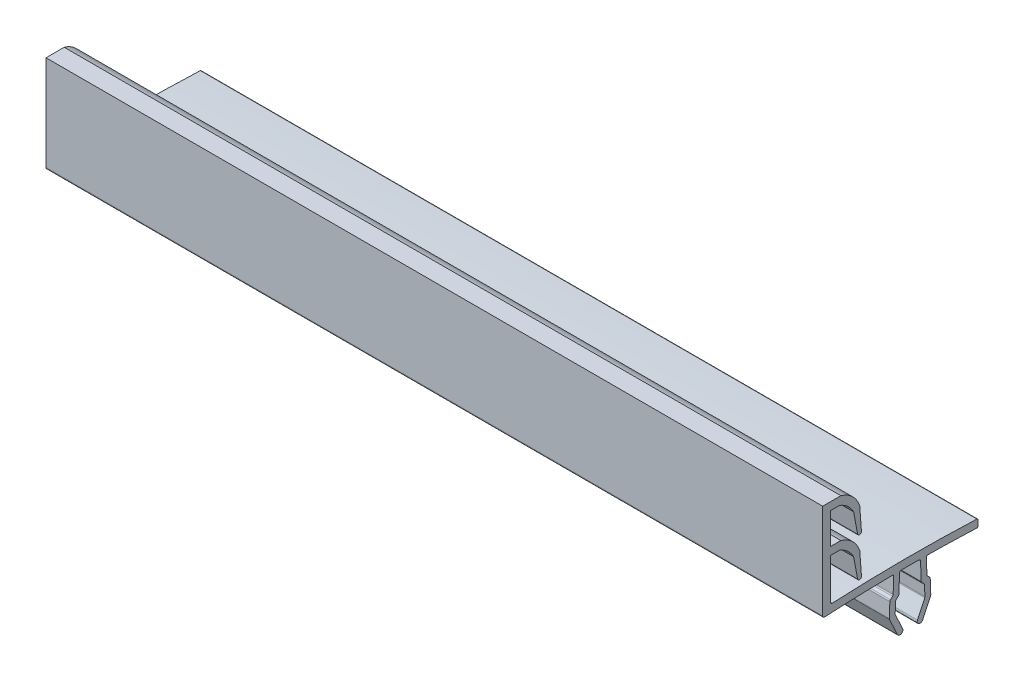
ISO-10303-21;
HEADER;
FILE_DESCRIPTION(('STEP AP214'),'2;1');
FILE_NAME('part.step','',(''),(''),'','','');
FILE_SCHEMA(('AUTOMOTIVE_DESIGN { 1 0 10303 214 1 1 1 1 }'));
ENDSEC;
DATA;
#1=APPLICATION_CONTEXT('core data for automotive mechanical design processes');
#2=APPLICATION_PROTOCOL_DEFINITION('international standard','automotive_design',2000,#1);
#3=PRODUCT_CONTEXT('',#1,'mechanical');
#4=PRODUCT('Part','Part','',(#3));
#5=PRODUCT_RELATED_PRODUCT_CATEGORY('part','',(#4));
#6=PRODUCT_DEFINITION_FORMATION('','',#4);
#7=PRODUCT_DEFINITION_CONTEXT('part definition',#1,'design');
#8=PRODUCT_DEFINITION('design','',#6,#7);
#9=PRODUCT_DEFINITION_SHAPE('','',#8);
#10=(LENGTH_UNIT() NAMED_UNIT(*) SI_UNIT(.MILLI.,.METRE.));
#11=(NAMED_UNIT(*) PLANE_ANGLE_UNIT() SI_UNIT($,.RADIAN.));
#12=(NAMED_UNIT(*) SI_UNIT($,.STERADIAN.) SOLID_ANGLE_UNIT());
#13=UNCERTAINTY_MEASURE_WITH_UNIT(LENGTH_MEASURE(1.E-05),#10,'distance_accuracy_value','');
#14=(GEOMETRIC_REPRESENTATION_CONTEXT(3) GLOBAL_UNCERTAINTY_ASSIGNED_CONTEXT((#13)) GLOBAL_UNIT_ASSIGNED_CONTEXT((#10,
#11,#12)) REPRESENTATION_CONTEXT('',''));
#15=CARTESIAN_POINT('',(0.,0.,0.));
#16=DIRECTION('',(0.,0.,1.));
#17=DIRECTION('',(1.,0.,0.));
#18=AXIS2_PLACEMENT_3D('',#15,#16,#17);
#19=CARTESIAN_POINT('',(200.,10.4500300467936,11.8138499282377));
#20=DIRECTION('',(-1.,0.,0.));
#21=DIRECTION('',(0.,0.,1.));
#22=AXIS2_PLACEMENT_3D('',#19,#20,#21);
#23=CYLINDRICAL_SURFACE('',#22,7.20469684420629);
#24=CARTESIAN_POINT('',(0.,10.4500300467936,11.8138499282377));
#25=DIRECTION('',(1.,0.,0.));
#26=DIRECTION('',(0.,0.,-1.));
#27=AXIS2_PLACEMENT_3D('',#24,#25,#26);
#28=CIRCLE('',#27,7.20469684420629);
#29=CARTESIAN_POINT('',(0.,12.655558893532,4.95503814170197));
#30=VERTEX_POINT('',#29);
#31=CARTESIAN_POINT('',(0.,17.373917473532,9.82200668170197));
#32=VERTEX_POINT('',#31);
#33=EDGE_CURVE('E642',#30,#32,#28,.T.);
#34=ORIENTED_EDGE('',*,*,#33,.T.);
#35=DIRECTION('',(-1.,0.,0.));
#36=VECTOR('',#35,1.);
#37=CARTESIAN_POINT('',(200.,17.373917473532,9.82200668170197));
#38=LINE('',#37,#36);
#39=CARTESIAN_POINT('',(200.,17.373917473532,9.82200668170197));
#40=VERTEX_POINT('',#39);
#41=EDGE_CURVE('E12',#40,#32,#38,.T.);
#42=ORIENTED_EDGE('',*,*,#41,.F.);
#43=CARTESIAN_POINT('',(200.,10.4500300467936,11.8138499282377));
#44=DIRECTION('',(1.,0.,0.));
#45=DIRECTION('',(0.,0.,-1.));
#46=AXIS2_PLACEMENT_3D('',#43,#44,#45);
#47=CIRCLE('',#46,7.20469684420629);
#48=CARTESIAN_POINT('',(200.,12.655558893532,4.95503814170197));
#49=VERTEX_POINT('',#48);
#50=EDGE_CURVE('E820',#49,#40,#47,.T.);
#51=ORIENTED_EDGE('',*,*,#50,.F.);
#52=DIRECTION('',(-1.,0.,0.));
#53=VECTOR('',#52,1.);
#54=CARTESIAN_POINT('',(200.,12.655558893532,4.95503814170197));
#55=LINE('',#54,#53);
#56=EDGE_CURVE('E638',#49,#30,#55,.T.);
#57=ORIENTED_EDGE('',*,*,#56,.T.);
#58=EDGE_LOOP('',(#34,#42,#51,#57));
#59=FACE_BOUND('',#58,.T.);
#60=ADVANCED_FACE('F229',(#59),#23,.T.);
#61=CARTESIAN_POINT('',(200.,17.373917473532,9.82200668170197));
#62=DIRECTION('',(0.,-1.,0.));
#63=DIRECTION('',(0.,0.,-1.));
#64=AXIS2_PLACEMENT_3D('',#61,#62,#63);
#65=PLANE('',#64);
#66=DIRECTION('',(0.,0.,1.));
#67=VECTOR('',#66,1.);
#68=CARTESIAN_POINT('',(0.,17.373917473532,9.82200668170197));
#69=LINE('',#68,#67);
#70=CARTESIAN_POINT('',(0.,17.373917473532,14.508298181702));
#71=VERTEX_POINT('',#70);
#72=EDGE_CURVE('E646',#32,#71,#69,.T.);
#73=ORIENTED_EDGE('',*,*,#72,.T.);
#74=DIRECTION('',(-1.,0.,0.));
#75=VECTOR('',#74,1.);
#76=CARTESIAN_POINT('',(200.,17.373917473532,14.508298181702));
#77=LINE('',#76,#75);
#78=CARTESIAN_POINT('',(200.,17.373917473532,14.508298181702));
#79=VERTEX_POINT('',#78);
#80=EDGE_CURVE('E238',#79,#71,#77,.T.);
#81=ORIENTED_EDGE('',*,*,#80,.F.);
#82=DIRECTION('',(0.,0.,1.));
#83=VECTOR('',#82,1.);
#84=CARTESIAN_POINT('',(200.,17.373917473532,9.82200668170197));
#85=LINE('',#84,#83);
#86=EDGE_CURVE('E445',#40,#79,#85,.T.);
#87=ORIENTED_EDGE('',*,*,#86,.F.);
#88=ORIENTED_EDGE('',*,*,#41,.T.);
#89=EDGE_LOOP('',(#73,#81,#87,#88));
#90=FACE_BOUND('',#89,.T.);
#91=ADVANCED_FACE('F1250',(#90),#65,.F.);
#92=CARTESIAN_POINT('',(200.,17.373917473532,14.508298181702));
#93=DIRECTION('',(0.,0.,-1.));
#94=DIRECTION('',(-1.,0.,0.));
#95=AXIS2_PLACEMENT_3D('',#92,#93,#94);
#96=PLANE('',#95);
#97=DIRECTION('',(0.,-1.,0.));
#98=VECTOR('',#97,1.);
#99=CARTESIAN_POINT('',(0.,17.373917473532,14.508298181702));
#100=LINE('',#99,#98);
#101=CARTESIAN_POINT('',(0.,-7.09746986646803,14.508298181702));
#102=VERTEX_POINT('',#101);
#103=EDGE_CURVE('E649',#71,#102,#100,.T.);
#104=ORIENTED_EDGE('',*,*,#103,.T.);
#105=DIRECTION('',(-1.,0.,0.));
#106=VECTOR('',#105,1.);
#107=CARTESIAN_POINT('',(200.,-7.09746986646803,14.508298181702));
#108=LINE('',#107,#106);
#109=CARTESIAN_POINT('',(200.,-7.09746986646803,14.508298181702));
#110=VERTEX_POINT('',#109);
#111=EDGE_CURVE('E1039',#110,#102,#108,.T.);
#112=ORIENTED_EDGE('',*,*,#111,.F.);
#113=DIRECTION('',(0.,-1.,0.));
#114=VECTOR('',#113,1.);
#115=CARTESIAN_POINT('',(200.,17.373917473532,14.508298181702));
#116=LINE('',#115,#114);
#117=EDGE_CURVE('E1049',#79,#110,#116,.T.);
#118=ORIENTED_EDGE('',*,*,#117,.F.);
#119=ORIENTED_EDGE('',*,*,#80,.T.);
#120=EDGE_LOOP('',(#104,#112,#118,#119));
#121=FACE_BOUND('',#120,.T.);
#122=ADVANCED_FACE('F1047',(#121),#96,.F.);
#123=CARTESIAN_POINT('',(200.,-7.09746987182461,14.0082981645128));
#124=DIRECTION('',(-1.,0.,0.));
#125=DIRECTION('',(0.,0.,1.));
#126=AXIS2_PLACEMENT_3D('',#123,#124,#125);
#127=CYLINDRICAL_SURFACE('',#126,0.500000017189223);
#128=CARTESIAN_POINT('',(0.,-7.09746987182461,14.0082981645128));
#129=DIRECTION('',(1.,0.,0.));
#130=DIRECTION('',(0.,0.,-1.));
#131=AXIS2_PLACEMENT_3D('',#128,#129,#130);
#132=CIRCLE('',#131,0.500000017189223);
#133=CARTESIAN_POINT('',(0.,-7.59671495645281,13.9808325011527));
#134=VERTEX_POINT('',#133);
#135=EDGE_CURVE('E652',#102,#134,#132,.T.);
#136=ORIENTED_EDGE('',*,*,#135,.T.);
#137=DIRECTION('',(-1.,0.,0.));
#138=VECTOR('',#137,1.);
#139=CARTESIAN_POINT('',(200.,-7.59671495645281,13.9808325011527));
#140=LINE('',#139,#138);
#141=CARTESIAN_POINT('',(200.,-7.59671495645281,13.9808325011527));
#142=VERTEX_POINT('',#141);
#143=EDGE_CURVE('E1035',#142,#134,#140,.T.);
#144=ORIENTED_EDGE('',*,*,#143,.F.);
#145=CARTESIAN_POINT('',(200.,-7.09746987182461,14.0082981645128));
#146=DIRECTION('',(1.,0.,0.));
#147=DIRECTION('',(0.,0.,-1.));
#148=AXIS2_PLACEMENT_3D('',#145,#146,#147);
#149=CIRCLE('',#148,0.500000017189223);
#150=EDGE_CURVE('E1068',#110,#142,#149,.T.);
#151=ORIENTED_EDGE('',*,*,#150,.F.);
#152=ORIENTED_EDGE('',*,*,#111,.T.);
#153=EDGE_LOOP('',(#136,#144,#151,#152));
#154=FACE_BOUND('',#153,.T.);
#155=ADVANCED_FACE('F1058',(#154),#127,.T.);
#156=CARTESIAN_POINT('',(200.,-406.992745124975,-7.99170113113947));
#157=DIRECTION('',(-1.,0.,0.));
#158=DIRECTION('',(0.,0.,1.));
#159=AXIS2_PLACEMENT_3D('',#156,#157,#158);
#160=CYLINDRICAL_SURFACE('',#159,399.999976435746);
#161=CARTESIAN_POINT('',(0.,-406.992745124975,-7.99170113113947));
#162=DIRECTION('',(-1.,0.,0.));
#163=DIRECTION('',(0.,0.,-1.));
#164=AXIS2_PLACEMENT_3D('',#161,#162,#163);
#165=CIRCLE('',#164,399.999976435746);
#166=CARTESIAN_POINT('',(0.,-7.01809016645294,-3.49097458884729));
#167=VERTEX_POINT('',#166);
#168=EDGE_CURVE('E655',#134,#167,#165,.T.);
#169=ORIENTED_EDGE('',*,*,#168,.T.);
#170=DIRECTION('',(-1.,0.,0.));
#171=VECTOR('',#170,1.);
#172=CARTESIAN_POINT('',(200.,-7.01809016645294,-3.49097458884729));
#173=LINE('',#172,#171);
#174=CARTESIAN_POINT('',(200.,-7.01809016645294,-3.49097458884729));
#175=VERTEX_POINT('',#174);
#176=EDGE_CURVE('E1031',#175,#167,#173,.T.);
#177=ORIENTED_EDGE('',*,*,#176,.F.);
#178=CARTESIAN_POINT('',(200.,-406.992745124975,-7.99170113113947));
#179=DIRECTION('',(-1.,0.,0.));
#180=DIRECTION('',(0.,0.,-1.));
#181=AXIS2_PLACEMENT_3D('',#178,#179,#180);
#182=CIRCLE('',#181,399.999976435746);
#183=EDGE_CURVE('E1064',#142,#175,#182,.T.);
#184=ORIENTED_EDGE('',*,*,#183,.F.);
#185=ORIENTED_EDGE('',*,*,#143,.T.);
#186=EDGE_LOOP('',(#169,#177,#184,#185));
#187=FACE_BOUND('',#186,.T.);
#188=ADVANCED_FACE('F1062',(#187),#160,.F.);
#189=CARTESIAN_POINT('',(200.,-7.31807118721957,-3.49435012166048));
#190=DIRECTION('',(-1.,0.,0.));
#191=DIRECTION('',(0.,0.,1.));
#192=AXIS2_PLACEMENT_3D('',#189,#190,#191);
#193=CYLINDRICAL_SURFACE('',#192,0.300000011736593);
#194=CARTESIAN_POINT('',(0.,-7.31807118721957,-3.49435012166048));
#195=DIRECTION('',(-1.,0.,0.));
#196=DIRECTION('',(0.,0.,-1.));
#197=AXIS2_PLACEMENT_3D('',#194,#195,#196);
#198=CIRCLE('',#197,0.300000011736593);
#199=CARTESIAN_POINT('',(0.,-7.32958751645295,-3.79412900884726));
#200=VERTEX_POINT('',#199);
#201=EDGE_CURVE('E658',#167,#200,#198,.T.);
#202=ORIENTED_EDGE('',*,*,#201,.T.);
#203=DIRECTION('',(-1.,0.,0.));
#204=VECTOR('',#203,1.);
#205=CARTESIAN_POINT('',(200.,-7.32958751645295,-3.79412900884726));
#206=LINE('',#205,#204);
#207=CARTESIAN_POINT('',(200.,-7.32958751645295,-3.79412900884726));
#208=VERTEX_POINT('',#207);
#209=EDGE_CURVE('E1027',#208,#200,#206,.T.);
#210=ORIENTED_EDGE('',*,*,#209,.F.);
#211=CARTESIAN_POINT('',(200.,-7.31807118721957,-3.49435012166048));
#212=DIRECTION('',(-1.,0.,0.));
#213=DIRECTION('',(0.,0.,-1.));
#214=AXIS2_PLACEMENT_3D('',#211,#212,#213);
#215=CIRCLE('',#214,0.300000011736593);
#216=EDGE_CURVE('E1067',#175,#208,#215,.T.);
#217=ORIENTED_EDGE('',*,*,#216,.F.);
#218=ORIENTED_EDGE('',*,*,#176,.T.);
#219=EDGE_LOOP('',(#202,#210,#217,#218));
#220=FACE_BOUND('',#219,.T.);
#221=ADVANCED_FACE('F1263',(#220),#193,.F.);
#222=CARTESIAN_POINT('',(200.,-7.32958751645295,-3.79412900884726));
#223=DIRECTION('',(0.,-0.0383878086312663,-0.999262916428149));
#224=DIRECTION('',(0.,0.999262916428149,-0.0383878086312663));
#225=AXIS2_PLACEMENT_3D('',#222,#223,#224);
#226=PLANE('',#225);
#227=DIRECTION('',(0.,-0.999262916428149,0.0383878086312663));
#228=VECTOR('',#227,1.);
#229=CARTESIAN_POINT('',(0.,-7.32958751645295,-3.79412900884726));
#230=LINE('',#229,#228);
#231=CARTESIAN_POINT('',(0.,-11.389820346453,-3.63815059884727));
#232=VERTEX_POINT('',#231);
#233=EDGE_CURVE('E661',#200,#232,#230,.T.);
#234=ORIENTED_EDGE('',*,*,#233,.T.);
#235=DIRECTION('',(-1.,0.,0.));
#236=VECTOR('',#235,1.);
#237=CARTESIAN_POINT('',(200.,-11.389820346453,-3.63815059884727));
#238=LINE('',#237,#236);
#239=CARTESIAN_POINT('',(200.,-11.389820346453,-3.63815059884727));
#240=VERTEX_POINT('',#239);
#241=EDGE_CURVE('E1023',#240,#232,#238,.T.);
#242=ORIENTED_EDGE('',*,*,#241,.F.);
#243=DIRECTION('',(0.,-0.999262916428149,0.0383878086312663));
#244=VECTOR('',#243,1.);
#245=CARTESIAN_POINT('',(200.,-7.32958751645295,-3.79412900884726));
#246=LINE('',#245,#244);
#247=EDGE_CURVE('E1072',#208,#240,#246,.T.);
#248=ORIENTED_EDGE('',*,*,#247,.F.);
#249=ORIENTED_EDGE('',*,*,#209,.T.);
#250=EDGE_LOOP('',(#234,#242,#248,#249));
#251=FACE_BOUND('',#250,.T.);
#252=ADVANCED_FACE('F1266',(#251),#226,.F.);
#253=CARTESIAN_POINT('',(200.,-11.3706264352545,-3.13851912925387));
#254=DIRECTION('',(-1.,0.,0.));
#255=DIRECTION('',(0.,0.,1.));
#256=AXIS2_PLACEMENT_3D('',#253,#254,#255);
#257=CYLINDRICAL_SURFACE('',#256,0.500000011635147);
#258=CARTESIAN_POINT('',(0.,-11.3706264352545,-3.13851912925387));
#259=DIRECTION('',(-1.,0.,0.));
#260=DIRECTION('',(0.,0.,-1.));
#261=AXIS2_PLACEMENT_3D('',#258,#259,#260);
#262=CIRCLE('',#261,0.500000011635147);
#263=CARTESIAN_POINT('',(0.,-11.7374913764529,-3.47823978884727));
#264=VERTEX_POINT('',#263);
#265=EDGE_CURVE('E664',#232,#264,#262,.T.);
#266=ORIENTED_EDGE('',*,*,#265,.T.);
#267=DIRECTION('',(-1.,0.,0.));
#268=VECTOR('',#267,1.);
#269=CARTESIAN_POINT('',(200.,-11.7374913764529,-3.47823978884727));
#270=LINE('',#269,#268);
#271=CARTESIAN_POINT('',(200.,-11.7374913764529,-3.47823978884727));
#272=VERTEX_POINT('',#271);
#273=EDGE_CURVE('E1019',#272,#264,#270,.T.);
#274=ORIENTED_EDGE('',*,*,#273,.F.);
#275=CARTESIAN_POINT('',(200.,-11.3706264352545,-3.13851912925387));
#276=DIRECTION('',(-1.,0.,0.));
#277=DIRECTION('',(0.,0.,-1.));
#278=AXIS2_PLACEMENT_3D('',#275,#276,#277);
#279=CIRCLE('',#278,0.500000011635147);
#280=EDGE_CURVE('E1079',#240,#272,#279,.T.);
#281=ORIENTED_EDGE('',*,*,#280,.F.);
#282=ORIENTED_EDGE('',*,*,#241,.T.);
#283=EDGE_LOOP('',(#266,#274,#281,#282));
#284=FACE_BOUND('',#283,.T.);
#285=ADVANCED_FACE('F1270',(#284),#257,.F.);
#286=CARTESIAN_POINT('',(200.,-11.7374913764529,-3.47823978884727));
#287=DIRECTION('',(0.,-0.733729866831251,-0.6794413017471));
#288=DIRECTION('',(0.,0.6794413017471,-0.733729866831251));
#289=AXIS2_PLACEMENT_3D('',#286,#287,#288);
#290=PLANE('',#289);
#291=DIRECTION('',(0.,-0.6794413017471,0.733729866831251));
#292=VECTOR('',#291,1.);
#293=CARTESIAN_POINT('',(0.,-11.7374913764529,-3.47823978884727));
#294=LINE('',#293,#292);
#295=CARTESIAN_POINT('',(0.,-12.224757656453,-2.95204006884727));
#296=VERTEX_POINT('',#295);
#297=EDGE_CURVE('E667',#264,#296,#294,.T.);
#298=ORIENTED_EDGE('',*,*,#297,.T.);
#299=DIRECTION('',(-1.,0.,0.));
#300=VECTOR('',#299,1.);
#301=CARTESIAN_POINT('',(200.,-12.224757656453,-2.95204006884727));
#302=LINE('',#301,#300);
#303=CARTESIAN_POINT('',(200.,-12.224757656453,-2.95204006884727));
#304=VERTEX_POINT('',#303);
#305=EDGE_CURVE('E1015',#304,#296,#302,.T.);
#306=ORIENTED_EDGE('',*,*,#305,.F.);
#307=DIRECTION('',(0.,-0.6794413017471,0.733729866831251));
#308=VECTOR('',#307,1.);
#309=CARTESIAN_POINT('',(200.,-11.7374913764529,-3.47823978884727));
#310=LINE('',#309,#308);
#311=EDGE_CURVE('E1082',#272,#304,#310,.T.);
#312=ORIENTED_EDGE('',*,*,#311,.F.);
#313=ORIENTED_EDGE('',*,*,#273,.T.);
#314=EDGE_LOOP('',(#298,#306,#312,#313));
#315=FACE_BOUND('',#314,.T.);
#316=ADVANCED_FACE('F1274',(#315),#290,.F.);
#317=CARTESIAN_POINT('',(200.,-12.5916225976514,-3.29176072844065));
#318=DIRECTION('',(-1.,0.,0.));
#319=DIRECTION('',(0.,0.,1.));
#320=AXIS2_PLACEMENT_3D('',#317,#318,#319);
#321=CYLINDRICAL_SURFACE('',#320,0.500000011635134);
#322=CARTESIAN_POINT('',(0.,-12.5916225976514,-3.29176072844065));
#323=DIRECTION('',(1.,0.,0.));
#324=DIRECTION('',(0.,0.,-1.));
#325=AXIS2_PLACEMENT_3D('',#322,#323,#324);
#326=CIRCLE('',#325,0.500000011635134);
#327=CARTESIAN_POINT('',(0.,-12.572428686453,-2.79212925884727));
#328=VERTEX_POINT('',#327);
#329=EDGE_CURVE('E670',#296,#328,#326,.T.);
#330=ORIENTED_EDGE('',*,*,#329,.T.);
#331=DIRECTION('',(-1.,0.,0.));
#332=VECTOR('',#331,1.);
#333=CARTESIAN_POINT('',(200.,-12.572428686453,-2.79212925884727));
#334=LINE('',#333,#332);
#335=CARTESIAN_POINT('',(200.,-12.572428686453,-2.79212925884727));
#336=VERTEX_POINT('',#335);
#337=EDGE_CURVE('E1011',#336,#328,#334,.T.);
#338=ORIENTED_EDGE('',*,*,#337,.F.);
#339=CARTESIAN_POINT('',(200.,-12.5916225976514,-3.29176072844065));
#340=DIRECTION('',(1.,0.,0.));
#341=DIRECTION('',(0.,0.,-1.));
#342=AXIS2_PLACEMENT_3D('',#339,#340,#341);
#343=CIRCLE('',#342,0.500000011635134);
#344=EDGE_CURVE('E1085',#304,#336,#343,.T.);
#345=ORIENTED_EDGE('',*,*,#344,.F.);
#346=ORIENTED_EDGE('',*,*,#305,.T.);
#347=EDGE_LOOP('',(#330,#338,#345,#346));
#348=FACE_BOUND('',#347,.T.);
#349=ADVANCED_FACE('F1278',(#348),#321,.T.);
#350=CARTESIAN_POINT('',(200.,-12.572428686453,-2.79212925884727));
#351=DIRECTION('',(0.,-0.0383878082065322,-0.999262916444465));
#352=DIRECTION('',(0.,0.999262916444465,-0.0383878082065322));
#353=AXIS2_PLACEMENT_3D('',#350,#351,#352);
#354=PLANE('',#353);
#355=DIRECTION('',(0.,-0.999262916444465,0.0383878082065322));
#356=VECTOR('',#355,1.);
#357=CARTESIAN_POINT('',(0.,-12.572428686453,-2.79212925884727));
#358=LINE('',#357,#356);
#359=CARTESIAN_POINT('',(0.,-16.273223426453,-2.64995906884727));
#360=VERTEX_POINT('',#359);
#361=EDGE_CURVE('E673',#328,#360,#358,.T.);
#362=ORIENTED_EDGE('',*,*,#361,.T.);
#363=DIRECTION('',(-1.,0.,0.));
#364=VECTOR('',#363,1.);
#365=CARTESIAN_POINT('',(200.,-16.273223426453,-2.64995906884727));
#366=LINE('',#365,#364);
#367=CARTESIAN_POINT('',(200.,-16.273223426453,-2.64995906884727));
#368=VERTEX_POINT('',#367);
#369=EDGE_CURVE('E1007',#368,#360,#366,.T.);
#370=ORIENTED_EDGE('',*,*,#369,.F.);
#371=DIRECTION('',(0.,-0.999262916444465,0.0383878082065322));
#372=VECTOR('',#371,1.);
#373=CARTESIAN_POINT('',(200.,-12.572428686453,-2.79212925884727));
#374=LINE('',#373,#372);
#375=EDGE_CURVE('E1088',#336,#368,#374,.T.);
#376=ORIENTED_EDGE('',*,*,#375,.F.);
#377=ORIENTED_EDGE('',*,*,#337,.T.);
#378=EDGE_LOOP('',(#362,#370,#376,#377));
#379=FACE_BOUND('',#378,.T.);
#380=ADVANCED_FACE('F1282',(#379),#354,.F.);
#381=CARTESIAN_POINT('',(200.,-16.2924173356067,-3.14959057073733));
#382=DIRECTION('',(-1.,0.,0.));
#383=DIRECTION('',(0.,0.,1.));
#384=AXIS2_PLACEMENT_3D('',#381,#382,#383);
#385=CYLINDRICAL_SURFACE('',#384,0.500000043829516);
#386=CARTESIAN_POINT('',(0.,-16.2924173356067,-3.14959057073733));
#387=DIRECTION('',(1.,0.,0.));
#388=DIRECTION('',(0.,0.,-1.));
#389=AXIS2_PLACEMENT_3D('',#386,#387,#388);
#390=CIRCLE('',#389,0.500000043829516);
#391=CARTESIAN_POINT('',(0.,-16.5037264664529,-2.69643662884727));
#392=VERTEX_POINT('',#391);
#393=EDGE_CURVE('E676',#360,#392,#390,.T.);
#394=ORIENTED_EDGE('',*,*,#393,.T.);
#395=DIRECTION('',(-1.,0.,0.));
#396=VECTOR('',#395,1.);
#397=CARTESIAN_POINT('',(200.,-16.5037264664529,-2.69643662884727));
#398=LINE('',#397,#396);
#399=CARTESIAN_POINT('',(200.,-16.5037264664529,-2.69643662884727));
#400=VERTEX_POINT('',#399);
#401=EDGE_CURVE('E1003',#400,#392,#398,.T.);
#402=ORIENTED_EDGE('',*,*,#401,.F.);
#403=CARTESIAN_POINT('',(200.,-16.2924173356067,-3.14959057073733));
#404=DIRECTION('',(1.,0.,0.));
#405=DIRECTION('',(0.,0.,-1.));
#406=AXIS2_PLACEMENT_3D('',#403,#404,#405);
#407=CIRCLE('',#406,0.500000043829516);
#408=EDGE_CURVE('E1091',#368,#400,#407,.T.);
#409=ORIENTED_EDGE('',*,*,#408,.F.);
#410=ORIENTED_EDGE('',*,*,#369,.T.);
#411=EDGE_LOOP('',(#394,#402,#409,#410));
#412=FACE_BOUND('',#411,.T.);
#413=ADVANCED_FACE('F1286',(#412),#385,.T.);
#414=CARTESIAN_POINT('',(200.,-16.5037264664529,-2.69643662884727));
#415=DIRECTION('',(0.,0.422618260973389,-0.906307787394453));
#416=DIRECTION('',(0.,0.906307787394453,0.422618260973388));
#417=AXIS2_PLACEMENT_3D('',#414,#415,#416);
#418=PLANE('',#417);
#419=DIRECTION('',(0.,-0.906307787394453,-0.422618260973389));
#420=VECTOR('',#419,1.);
#421=CARTESIAN_POINT('',(0.,-16.5037264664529,-2.69643662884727));
#422=LINE('',#421,#420);
#423=CARTESIAN_POINT('',(0.,-20.8545077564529,-4.72523925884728));
#424=VERTEX_POINT('',#423);
#425=EDGE_CURVE('E679',#392,#424,#422,.T.);
#426=ORIENTED_EDGE('',*,*,#425,.T.);
#427=DIRECTION('',(-1.,0.,0.));
#428=VECTOR('',#427,1.);
#429=CARTESIAN_POINT('',(200.,-20.8545077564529,-4.72523925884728));
#430=LINE('',#429,#428);
#431=CARTESIAN_POINT('',(200.,-20.8545077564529,-4.72523925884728));
#432=VERTEX_POINT('',#431);
#433=EDGE_CURVE('E999',#432,#424,#430,.T.);
#434=ORIENTED_EDGE('',*,*,#433,.F.);
#435=DIRECTION('',(0.,-0.906307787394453,-0.422618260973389));
#436=VECTOR('',#435,1.);
#437=CARTESIAN_POINT('',(200.,-16.5037264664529,-2.69643662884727));
#438=LINE('',#437,#436);
#439=EDGE_CURVE('E1094',#400,#432,#438,.T.);
#440=ORIENTED_EDGE('',*,*,#439,.F.);
#441=ORIENTED_EDGE('',*,*,#401,.T.);
#442=EDGE_LOOP('',(#426,#434,#440,#441));
#443=FACE_BOUND('',#442,.T.);
#444=ADVANCED_FACE('F1290',(#443),#418,.F.);
#445=CARTESIAN_POINT('',(200.,-20.5375440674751,-5.40497010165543));
#446=DIRECTION('',(-1.,0.,0.));
#447=DIRECTION('',(0.,0.,1.));
#448=AXIS2_PLACEMENT_3D('',#445,#446,#447);
#449=CYLINDRICAL_SURFACE('',#448,0.749999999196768);
#450=CARTESIAN_POINT('',(0.,-20.5375440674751,-5.40497010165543));
#451=DIRECTION('',(1.,0.,0.));
#452=DIRECTION('',(0.,0.,-1.));
#453=AXIS2_PLACEMENT_3D('',#450,#451,#452);
#454=CIRCLE('',#453,0.749999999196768);
#455=CARTESIAN_POINT('',(0.,-20.2205803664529,-6.08470093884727));
#456=VERTEX_POINT('',#455);
#457=EDGE_CURVE('E682',#424,#456,#454,.T.);
#458=ORIENTED_EDGE('',*,*,#457,.T.);
#459=DIRECTION('',(-1.,0.,0.));
#460=VECTOR('',#459,1.);
#461=CARTESIAN_POINT('',(200.,-20.2205803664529,-6.08470093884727));
#462=LINE('',#461,#460);
#463=CARTESIAN_POINT('',(200.,-20.2205803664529,-6.08470093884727));
#464=VERTEX_POINT('',#463);
#465=EDGE_CURVE('E995',#464,#456,#462,.T.);
#466=ORIENTED_EDGE('',*,*,#465,.F.);
#467=CARTESIAN_POINT('',(200.,-20.5375440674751,-5.40497010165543));
#468=DIRECTION('',(1.,0.,0.));
#469=DIRECTION('',(0.,0.,-1.));
#470=AXIS2_PLACEMENT_3D('',#467,#468,#469);
#471=CIRCLE('',#470,0.749999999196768);
#472=EDGE_CURVE('E1097',#432,#464,#471,.T.);
#473=ORIENTED_EDGE('',*,*,#472,.F.);
#474=ORIENTED_EDGE('',*,*,#433,.T.);
#475=EDGE_LOOP('',(#458,#466,#473,#474));
#476=FACE_BOUND('',#475,.T.);
#477=ADVANCED_FACE('F1294',(#476),#449,.T.);
#478=CARTESIAN_POINT('',(200.,-20.2205803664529,-6.08470093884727));
#479=DIRECTION('',(0.,-0.422618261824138,0.906307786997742));
#480=DIRECTION('',(0.,-0.906307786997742,-0.422618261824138));
#481=AXIS2_PLACEMENT_3D('',#478,#479,#480);
#482=PLANE('',#481);
#483=DIRECTION('',(0.,0.906307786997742,0.422618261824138));
#484=VECTOR('',#483,1.);
#485=CARTESIAN_POINT('',(0.,-20.2205803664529,-6.08470093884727));
#486=LINE('',#485,#484);
#487=CARTESIAN_POINT('',(0.,-16.1986874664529,-4.20926147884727));
#488=VERTEX_POINT('',#487);
#489=EDGE_CURVE('E685',#456,#488,#486,.T.);
#490=ORIENTED_EDGE('',*,*,#489,.T.);
#491=DIRECTION('',(-1.,0.,0.));
#492=VECTOR('',#491,1.);
#493=CARTESIAN_POINT('',(200.,-16.1986874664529,-4.20926147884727));
#494=LINE('',#493,#492);
#495=CARTESIAN_POINT('',(200.,-16.1986874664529,-4.20926147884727));
#496=VERTEX_POINT('',#495);
#497=EDGE_CURVE('E991',#496,#488,#494,.T.);
#498=ORIENTED_EDGE('',*,*,#497,.F.);
#499=DIRECTION('',(0.,0.906307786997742,0.422618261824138));
#500=VECTOR('',#499,1.);
#501=CARTESIAN_POINT('',(200.,-20.2205803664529,-6.08470093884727));
#502=LINE('',#501,#500);
#503=EDGE_CURVE('E1100',#464,#496,#502,.T.);
#504=ORIENTED_EDGE('',*,*,#503,.F.);
#505=ORIENTED_EDGE('',*,*,#465,.T.);
#506=EDGE_LOOP('',(#490,#498,#504,#505));
#507=FACE_BOUND('',#506,.T.);
#508=ADVANCED_FACE('F1298',(#507),#482,.F.);
#509=CARTESIAN_POINT('',(200.,-15.9873783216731,-4.66241548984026));
#510=DIRECTION('',(-1.,0.,0.));
#511=DIRECTION('',(0.,0.,1.));
#512=AXIS2_PLACEMENT_3D('',#509,#510,#511);
#513=CYLINDRICAL_SURFACE('',#512,0.500000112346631);
#514=CARTESIAN_POINT('',(0.,-15.9873783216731,-4.66241548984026));
#515=DIRECTION('',(-1.,0.,0.));
#516=DIRECTION('',(0.,0.,-1.));
#517=AXIS2_PLACEMENT_3D('',#514,#515,#516);
#518=CIRCLE('',#517,0.500000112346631);
#519=CARTESIAN_POINT('',(0.,-15.9681844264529,-4.16278391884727));
#520=VERTEX_POINT('',#519);
#521=EDGE_CURVE('E688',#488,#520,#518,.T.);
#522=ORIENTED_EDGE('',*,*,#521,.T.);
#523=DIRECTION('',(-1.,0.,0.));
#524=VECTOR('',#523,1.);
#525=CARTESIAN_POINT('',(200.,-15.9681844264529,-4.16278391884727));
#526=LINE('',#525,#524);
#527=CARTESIAN_POINT('',(200.,-15.9681844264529,-4.16278391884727));
#528=VERTEX_POINT('',#527);
#529=EDGE_CURVE('E987',#528,#520,#526,.T.);
#530=ORIENTED_EDGE('',*,*,#529,.F.);
#531=CARTESIAN_POINT('',(200.,-15.9873783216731,-4.66241548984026));
#532=DIRECTION('',(-1.,0.,0.));
#533=DIRECTION('',(0.,0.,-1.));
#534=AXIS2_PLACEMENT_3D('',#531,#532,#533);
#535=CIRCLE('',#534,0.500000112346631);
#536=EDGE_CURVE('E1103',#496,#528,#535,.T.);
#537=ORIENTED_EDGE('',*,*,#536,.F.);
#538=ORIENTED_EDGE('',*,*,#497,.T.);
#539=EDGE_LOOP('',(#522,#530,#537,#538));
#540=FACE_BOUND('',#539,.T.);
#541=ADVANCED_FACE('F1302',(#540),#513,.F.);
#542=CARTESIAN_POINT('',(200.,-15.9681844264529,-4.16278391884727));
#543=DIRECTION('',(0.,0.0383878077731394,0.999262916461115));
#544=DIRECTION('',(0.,-0.999262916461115,0.0383878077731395));
#545=AXIS2_PLACEMENT_3D('',#542,#543,#544);
#546=PLANE('',#545);
#547=DIRECTION('',(0.,0.999262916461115,-0.0383878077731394));
#548=VECTOR('',#547,1.);
#549=CARTESIAN_POINT('',(0.,-15.9681844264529,-4.16278391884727));
#550=LINE('',#549,#548);
#551=CARTESIAN_POINT('',(0.,-13.250872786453,-4.26717249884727));
#552=VERTEX_POINT('',#551);
#553=EDGE_CURVE('E691',#520,#552,#550,.T.);
#554=ORIENTED_EDGE('',*,*,#553,.T.);
#555=DIRECTION('',(-1.,0.,0.));
#556=VECTOR('',#555,1.);
#557=CARTESIAN_POINT('',(200.,-13.250872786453,-4.26717249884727));
#558=LINE('',#557,#556);
#559=CARTESIAN_POINT('',(200.,-13.250872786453,-4.26717249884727));
#560=VERTEX_POINT('',#559);
#561=EDGE_CURVE('E983',#560,#552,#558,.T.);
#562=ORIENTED_EDGE('',*,*,#561,.F.);
#563=DIRECTION('',(0.,0.999262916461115,-0.0383878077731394));
#564=VECTOR('',#563,1.);
#565=CARTESIAN_POINT('',(200.,-15.9681844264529,-4.16278391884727));
#566=LINE('',#565,#564);
#567=EDGE_CURVE('E1106',#528,#560,#566,.T.);
#568=ORIENTED_EDGE('',*,*,#567,.F.);
#569=ORIENTED_EDGE('',*,*,#529,.T.);
#570=EDGE_LOOP('',(#554,#562,#568,#569));
#571=FACE_BOUND('',#570,.T.);
#572=ADVANCED_FACE('F1306',(#571),#546,.F.);
#573=CARTESIAN_POINT('',(200.,-13.2700666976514,-4.76680396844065));
#574=DIRECTION('',(-1.,0.,0.));
#575=DIRECTION('',(0.,0.,1.));
#576=AXIS2_PLACEMENT_3D('',#573,#574,#575);
#577=CYLINDRICAL_SURFACE('',#576,0.500000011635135);
#578=CARTESIAN_POINT('',(0.,-13.2700666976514,-4.76680396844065));
#579=DIRECTION('',(-1.,0.,0.));
#580=DIRECTION('',(0.,0.,-1.));
#581=AXIS2_PLACEMENT_3D('',#578,#579,#580);
#582=CIRCLE('',#581,0.500000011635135);
#583=CARTESIAN_POINT('',(0.,-12.9032017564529,-4.42708330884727));
#584=VERTEX_POINT('',#583);
#585=EDGE_CURVE('E694',#552,#584,#582,.T.);
#586=ORIENTED_EDGE('',*,*,#585,.T.);
#587=DIRECTION('',(-1.,0.,0.));
#588=VECTOR('',#587,1.);
#589=CARTESIAN_POINT('',(200.,-12.9032017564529,-4.42708330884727));
#590=LINE('',#589,#588);
#591=CARTESIAN_POINT('',(200.,-12.9032017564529,-4.42708330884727));
#592=VERTEX_POINT('',#591);
#593=EDGE_CURVE('E979',#592,#584,#590,.T.);
#594=ORIENTED_EDGE('',*,*,#593,.F.);
#595=CARTESIAN_POINT('',(200.,-13.2700666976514,-4.76680396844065));
#596=DIRECTION('',(-1.,0.,0.));
#597=DIRECTION('',(0.,0.,-1.));
#598=AXIS2_PLACEMENT_3D('',#595,#596,#597);
#599=CIRCLE('',#598,0.500000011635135);
#600=EDGE_CURVE('E1109',#560,#592,#599,.T.);
#601=ORIENTED_EDGE('',*,*,#600,.F.);
#602=ORIENTED_EDGE('',*,*,#561,.T.);
#603=EDGE_LOOP('',(#586,#594,#601,#602));
#604=FACE_BOUND('',#603,.T.);
#605=ADVANCED_FACE('F1310',(#604),#577,.F.);
#606=CARTESIAN_POINT('',(200.,-12.9032017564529,-4.42708330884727));
#607=DIRECTION('',(0.,0.733729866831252,0.6794413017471));
#608=DIRECTION('',(0.,-0.6794413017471,0.733729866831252));
#609=AXIS2_PLACEMENT_3D('',#606,#607,#608);
#610=PLANE('',#609);
#611=DIRECTION('',(0.,0.6794413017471,-0.733729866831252));
#612=VECTOR('',#611,1.);
#613=CARTESIAN_POINT('',(0.,-12.9032017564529,-4.42708330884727));
#614=LINE('',#613,#612);
#615=CARTESIAN_POINT('',(0.,-12.4159354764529,-4.95328302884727));
#616=VERTEX_POINT('',#615);
#617=EDGE_CURVE('E697',#584,#616,#614,.T.);
#618=ORIENTED_EDGE('',*,*,#617,.T.);
#619=DIRECTION('',(-1.,0.,0.));
#620=VECTOR('',#619,1.);
#621=CARTESIAN_POINT('',(200.,-12.4159354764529,-4.95328302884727));
#622=LINE('',#621,#620);
#623=CARTESIAN_POINT('',(200.,-12.4159354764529,-4.95328302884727));
#624=VERTEX_POINT('',#623);
#625=EDGE_CURVE('E975',#624,#616,#622,.T.);
#626=ORIENTED_EDGE('',*,*,#625,.F.);
#627=DIRECTION('',(0.,0.6794413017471,-0.733729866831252));
#628=VECTOR('',#627,1.);
#629=CARTESIAN_POINT('',(200.,-12.9032017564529,-4.42708330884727));
#630=LINE('',#629,#628);
#631=EDGE_CURVE('E1112',#592,#624,#630,.T.);
#632=ORIENTED_EDGE('',*,*,#631,.F.);
#633=ORIENTED_EDGE('',*,*,#593,.T.);
#634=EDGE_LOOP('',(#618,#626,#632,#633));
#635=FACE_BOUND('',#634,.T.);
#636=ADVANCED_FACE('F1314',(#635),#610,.F.);
#637=CARTESIAN_POINT('',(200.,-12.0490705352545,-4.61356236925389));
#638=DIRECTION('',(-1.,0.,0.));
#639=DIRECTION('',(0.,0.,1.));
#640=AXIS2_PLACEMENT_3D('',#637,#638,#639);
#641=CYLINDRICAL_SURFACE('',#640,0.500000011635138);
#642=CARTESIAN_POINT('',(0.,-12.0490705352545,-4.61356236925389));
#643=DIRECTION('',(1.,0.,0.));
#644=DIRECTION('',(0.,0.,-1.));
#645=AXIS2_PLACEMENT_3D('',#642,#643,#644);
#646=CIRCLE('',#645,0.500000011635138);
#647=CARTESIAN_POINT('',(0.,-12.068264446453,-5.11319383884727));
#648=VERTEX_POINT('',#647);
#649=EDGE_CURVE('E700',#616,#648,#646,.T.);
#650=ORIENTED_EDGE('',*,*,#649,.T.);
#651=DIRECTION('',(-1.,0.,0.));
#652=VECTOR('',#651,1.);
#653=CARTESIAN_POINT('',(200.,-12.068264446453,-5.11319383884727));
#654=LINE('',#653,#652);
#655=CARTESIAN_POINT('',(200.,-12.068264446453,-5.11319383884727));
#656=VERTEX_POINT('',#655);
#657=EDGE_CURVE('E971',#656,#648,#654,.T.);
#658=ORIENTED_EDGE('',*,*,#657,.F.);
#659=CARTESIAN_POINT('',(200.,-12.0490705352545,-4.61356236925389));
#660=DIRECTION('',(1.,0.,0.));
#661=DIRECTION('',(0.,0.,-1.));
#662=AXIS2_PLACEMENT_3D('',#659,#660,#661);
#663=CIRCLE('',#662,0.500000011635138);
#664=EDGE_CURVE('E1115',#624,#656,#663,.T.);
#665=ORIENTED_EDGE('',*,*,#664,.F.);
#666=ORIENTED_EDGE('',*,*,#625,.T.);
#667=EDGE_LOOP('',(#650,#658,#665,#666));
#668=FACE_BOUND('',#667,.T.);
#669=ADVANCED_FACE('F1318',(#668),#641,.T.);
#670=CARTESIAN_POINT('',(200.,-12.068264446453,-5.11319383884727));
#671=DIRECTION('',(0.,0.038387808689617,0.999262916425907));
#672=DIRECTION('',(0.,-0.999262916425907,0.038387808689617));
#673=AXIS2_PLACEMENT_3D('',#670,#671,#672);
#674=PLANE('',#673);
#675=DIRECTION('',(0.,0.999262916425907,-0.038387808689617));
#676=VECTOR('',#675,1.);
#677=CARTESIAN_POINT('',(0.,-12.068264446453,-5.11319383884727));
#678=LINE('',#677,#676);
#679=CARTESIAN_POINT('',(0.,-7.47964672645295,-5.28947074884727));
#680=VERTEX_POINT('',#679);
#681=EDGE_CURVE('E703',#648,#680,#678,.T.);
#682=ORIENTED_EDGE('',*,*,#681,.T.);
#683=DIRECTION('',(-1.,0.,0.));
#684=VECTOR('',#683,1.);
#685=CARTESIAN_POINT('',(200.,-7.47964672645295,-5.28947074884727));
#686=LINE('',#685,#684);
#687=CARTESIAN_POINT('',(200.,-7.47964672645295,-5.28947074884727));
#688=VERTEX_POINT('',#687);
#689=EDGE_CURVE('E967',#688,#680,#686,.T.);
#690=ORIENTED_EDGE('',*,*,#689,.F.);
#691=DIRECTION('',(0.,0.999262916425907,-0.038387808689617));
#692=VECTOR('',#691,1.);
#693=CARTESIAN_POINT('',(200.,-12.068264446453,-5.11319383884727));
#694=LINE('',#693,#692);
#695=EDGE_CURVE('E1118',#656,#688,#694,.T.);
#696=ORIENTED_EDGE('',*,*,#695,.F.);
#697=ORIENTED_EDGE('',*,*,#657,.T.);
#698=EDGE_LOOP('',(#682,#690,#696,#697));
#699=FACE_BOUND('',#698,.T.);
#700=ADVANCED_FACE('F1322',(#699),#674,.F.);
#701=CARTESIAN_POINT('',(200.,-7.49884062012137,-5.78910220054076));
#702=DIRECTION('',(-1.,0.,0.));
#703=DIRECTION('',(0.,0.,1.));
#704=AXIS2_PLACEMENT_3D('',#701,#702,#703);
#705=CYLINDRICAL_SURFACE('',#704,0.499999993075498);
#706=CARTESIAN_POINT('',(0.,-7.49884062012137,-5.78910220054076));
#707=DIRECTION('',(-1.,0.,0.));
#708=DIRECTION('',(0.,0.,-1.));
#709=AXIS2_PLACEMENT_3D('',#706,#707,#708);
#710=CIRCLE('',#709,0.499999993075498);
#711=CARTESIAN_POINT('',(0.,-6.99884822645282,-5.78634550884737));
#712=VERTEX_POINT('',#711);
#713=EDGE_CURVE('E706',#680,#712,#710,.T.);
#714=ORIENTED_EDGE('',*,*,#713,.T.);
#715=DIRECTION('',(-1.,0.,0.));
#716=VECTOR('',#715,1.);
#717=CARTESIAN_POINT('',(200.,-6.99884822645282,-5.78634550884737));
#718=LINE('',#717,#716);
#719=CARTESIAN_POINT('',(200.,-6.99884822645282,-5.78634550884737));
#720=VERTEX_POINT('',#719);
#721=EDGE_CURVE('E963',#720,#712,#718,.T.);
#722=ORIENTED_EDGE('',*,*,#721,.F.);
#723=CARTESIAN_POINT('',(200.,-7.49884062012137,-5.78910220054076));
#724=DIRECTION('',(-1.,0.,0.));
#725=DIRECTION('',(0.,0.,-1.));
#726=AXIS2_PLACEMENT_3D('',#723,#724,#725);
#727=CIRCLE('',#726,0.499999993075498);
#728=EDGE_CURVE('E1121',#688,#720,#727,.T.);
#729=ORIENTED_EDGE('',*,*,#728,.F.);
#730=ORIENTED_EDGE('',*,*,#689,.T.);
#731=EDGE_LOOP('',(#714,#722,#729,#730));
#732=FACE_BOUND('',#731,.T.);
#733=ADVANCED_FACE('F1326',(#732),#705,.F.);
#734=CARTESIAN_POINT('',(200.,-406.992886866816,-7.99170182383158));
#735=DIRECTION('',(-1.,0.,0.));
#736=DIRECTION('',(0.,0.,1.));
#737=AXIS2_PLACEMENT_3D('',#734,#735,#736);
#738=CYLINDRICAL_SURFACE('',#737,400.000118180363);
#739=CARTESIAN_POINT('',(0.,-406.992886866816,-7.99170182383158));
#740=DIRECTION('',(-1.,0.,0.));
#741=DIRECTION('',(0.,0.,-1.));
#742=AXIS2_PLACEMENT_3D('',#739,#740,#741);
#743=CIRCLE('',#742,400.000118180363);
#744=CARTESIAN_POINT('',(0.,-6.99884822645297,-10.1970581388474));
#745=VERTEX_POINT('',#744);
#746=EDGE_CURVE('E709',#712,#745,#743,.T.);
#747=ORIENTED_EDGE('',*,*,#746,.T.);
#748=DIRECTION('',(-1.,0.,0.));
#749=VECTOR('',#748,1.);
#750=CARTESIAN_POINT('',(200.,-6.99884822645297,-10.1970581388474));
#751=LINE('',#750,#749);
#752=CARTESIAN_POINT('',(200.,-6.99884822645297,-10.1970581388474));
#753=VERTEX_POINT('',#752);
#754=EDGE_CURVE('E959',#753,#745,#751,.T.);
#755=ORIENTED_EDGE('',*,*,#754,.F.);
#756=CARTESIAN_POINT('',(200.,-406.992886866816,-7.99170182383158));
#757=DIRECTION('',(-1.,0.,0.));
#758=DIRECTION('',(0.,0.,-1.));
#759=AXIS2_PLACEMENT_3D('',#756,#757,#758);
#760=CIRCLE('',#759,400.000118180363);
#761=EDGE_CURVE('E1124',#720,#753,#760,.T.);
#762=ORIENTED_EDGE('',*,*,#761,.F.);
#763=ORIENTED_EDGE('',*,*,#721,.T.);
#764=EDGE_LOOP('',(#747,#755,#762,#763));
#765=FACE_BOUND('',#764,.T.);
#766=ADVANCED_FACE('F1330',(#765),#738,.F.);
#767=CARTESIAN_POINT('',(200.,-7.49884063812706,-10.1943014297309));
#768=DIRECTION('',(-1.,0.,0.));
#769=DIRECTION('',(0.,0.,1.));
#770=AXIS2_PLACEMENT_3D('',#767,#768,#769);
#771=CYLINDRICAL_SURFACE('',#770,0.500000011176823);
#772=CARTESIAN_POINT('',(0.,-7.49884063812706,-10.1943014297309));
#773=DIRECTION('',(-1.,0.,0.));
#774=DIRECTION('',(0.,0.,-1.));
#775=AXIS2_PLACEMENT_3D('',#772,#773,#774);
#776=CIRCLE('',#775,0.500000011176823);
#777=CARTESIAN_POINT('',(0.,-7.47964672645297,-10.6939328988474));
#778=VERTEX_POINT('',#777);
#779=EDGE_CURVE('E712',#745,#778,#776,.T.);
#780=ORIENTED_EDGE('',*,*,#779,.T.);
#781=DIRECTION('',(-1.,0.,0.));
#782=VECTOR('',#781,1.);
#783=CARTESIAN_POINT('',(200.,-7.47964672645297,-10.6939328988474));
#784=LINE('',#783,#782);
#785=CARTESIAN_POINT('',(200.,-7.47964672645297,-10.6939328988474));
#786=VERTEX_POINT('',#785);
#787=EDGE_CURVE('E955',#786,#778,#784,.T.);
#788=ORIENTED_EDGE('',*,*,#787,.F.);
#789=CARTESIAN_POINT('',(200.,-7.49884063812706,-10.1943014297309));
#790=DIRECTION('',(-1.,0.,0.));
#791=DIRECTION('',(0.,0.,-1.));
#792=AXIS2_PLACEMENT_3D('',#789,#790,#791);
#793=CIRCLE('',#792,0.500000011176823);
#794=EDGE_CURVE('E1127',#753,#786,#793,.T.);
#795=ORIENTED_EDGE('',*,*,#794,.F.);
#796=ORIENTED_EDGE('',*,*,#754,.T.);
#797=EDGE_LOOP('',(#780,#788,#795,#796));
#798=FACE_BOUND('',#797,.T.);
#799=ADVANCED_FACE('F1334',(#798),#771,.F.);
#800=CARTESIAN_POINT('',(200.,-7.47964672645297,-10.6939328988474));
#801=DIRECTION('',(0.,0.0383878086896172,-0.999262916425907));
#802=DIRECTION('',(0.,0.999262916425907,0.0383878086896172));
#803=AXIS2_PLACEMENT_3D('',#800,#801,#802);
#804=PLANE('',#803);
#805=DIRECTION('',(0.,-0.999262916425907,-0.0383878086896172));
#806=VECTOR('',#805,1.);
#807=CARTESIAN_POINT('',(0.,-7.47964672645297,-10.6939328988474));
#808=LINE('',#807,#806);
#809=CARTESIAN_POINT('',(0.,-12.068264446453,-10.8702098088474));
#810=VERTEX_POINT('',#809);
#811=EDGE_CURVE('E715',#778,#810,#808,.T.);
#812=ORIENTED_EDGE('',*,*,#811,.T.);
#813=DIRECTION('',(-1.,0.,0.));
#814=VECTOR('',#813,1.);
#815=CARTESIAN_POINT('',(200.,-12.068264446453,-10.8702098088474));
#816=LINE('',#815,#814);
#817=CARTESIAN_POINT('',(200.,-12.068264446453,-10.8702098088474));
#818=VERTEX_POINT('',#817);
#819=EDGE_CURVE('E951',#818,#810,#816,.T.);
#820=ORIENTED_EDGE('',*,*,#819,.F.);
#821=DIRECTION('',(0.,-0.999262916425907,-0.0383878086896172));
#822=VECTOR('',#821,1.);
#823=CARTESIAN_POINT('',(200.,-7.47964672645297,-10.6939328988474));
#824=LINE('',#823,#822);
#825=EDGE_CURVE('E1130',#786,#818,#824,.T.);
#826=ORIENTED_EDGE('',*,*,#825,.F.);
#827=ORIENTED_EDGE('',*,*,#787,.T.);
#828=EDGE_LOOP('',(#812,#820,#826,#827));
#829=FACE_BOUND('',#828,.T.);
#830=ADVANCED_FACE('F1338',(#829),#804,.F.);
#831=CARTESIAN_POINT('',(200.,-12.0490705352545,-11.3698412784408));
#832=DIRECTION('',(-1.,0.,0.));
#833=DIRECTION('',(0.,0.,1.));
#834=AXIS2_PLACEMENT_3D('',#831,#832,#833);
#835=CYLINDRICAL_SURFACE('',#834,0.500000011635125);
#836=CARTESIAN_POINT('',(0.,-12.0490705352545,-11.3698412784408));
#837=DIRECTION('',(1.,0.,0.));
#838=DIRECTION('',(0.,0.,-1.));
#839=AXIS2_PLACEMENT_3D('',#836,#837,#838);
#840=CIRCLE('',#839,0.500000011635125);
#841=CARTESIAN_POINT('',(0.,-12.415935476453,-11.0301206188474));
#842=VERTEX_POINT('',#841);
#843=EDGE_CURVE('E718',#810,#842,#840,.T.);
#844=ORIENTED_EDGE('',*,*,#843,.T.);
#845=DIRECTION('',(-1.,0.,0.));
#846=VECTOR('',#845,1.);
#847=CARTESIAN_POINT('',(200.,-12.415935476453,-11.0301206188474));
#848=LINE('',#847,#846);
#849=CARTESIAN_POINT('',(200.,-12.415935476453,-11.0301206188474));
#850=VERTEX_POINT('',#849);
#851=EDGE_CURVE('E947',#850,#842,#848,.T.);
#852=ORIENTED_EDGE('',*,*,#851,.F.);
#853=CARTESIAN_POINT('',(200.,-12.0490705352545,-11.3698412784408));
#854=DIRECTION('',(1.,0.,0.));
#855=DIRECTION('',(0.,0.,-1.));
#856=AXIS2_PLACEMENT_3D('',#853,#854,#855);
#857=CIRCLE('',#856,0.500000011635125);
#858=EDGE_CURVE('E1133',#818,#850,#857,.T.);
#859=ORIENTED_EDGE('',*,*,#858,.F.);
#860=ORIENTED_EDGE('',*,*,#819,.T.);
#861=EDGE_LOOP('',(#844,#852,#859,#860));
#862=FACE_BOUND('',#861,.T.);
#863=ADVANCED_FACE('F1342',(#862),#835,.T.);
#864=CARTESIAN_POINT('',(200.,-12.415935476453,-11.0301206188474));
#865=DIRECTION('',(0.,0.733729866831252,-0.6794413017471));
#866=DIRECTION('',(0.,0.6794413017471,0.733729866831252));
#867=AXIS2_PLACEMENT_3D('',#864,#865,#866);
#868=PLANE('',#867);
#869=DIRECTION('',(0.,-0.6794413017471,-0.733729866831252));
#870=VECTOR('',#869,1.);
#871=CARTESIAN_POINT('',(0.,-12.415935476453,-11.0301206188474));
#872=LINE('',#871,#870);
#873=CARTESIAN_POINT('',(0.,-12.903201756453,-11.5563203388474));
#874=VERTEX_POINT('',#873);
#875=EDGE_CURVE('E721',#842,#874,#872,.T.);
#876=ORIENTED_EDGE('',*,*,#875,.T.);
#877=DIRECTION('',(-1.,0.,0.));
#878=VECTOR('',#877,1.);
#879=CARTESIAN_POINT('',(200.,-12.903201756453,-11.5563203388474));
#880=LINE('',#879,#878);
#881=CARTESIAN_POINT('',(200.,-12.903201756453,-11.5563203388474));
#882=VERTEX_POINT('',#881);
#883=EDGE_CURVE('E943',#882,#874,#880,.T.);
#884=ORIENTED_EDGE('',*,*,#883,.F.);
#885=DIRECTION('',(0.,-0.6794413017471,-0.733729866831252));
#886=VECTOR('',#885,1.);
#887=CARTESIAN_POINT('',(200.,-12.415935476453,-11.0301206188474));
#888=LINE('',#887,#886);
#889=EDGE_CURVE('E1136',#850,#882,#888,.T.);
#890=ORIENTED_EDGE('',*,*,#889,.F.);
#891=ORIENTED_EDGE('',*,*,#851,.T.);
#892=EDGE_LOOP('',(#876,#884,#890,#891));
#893=FACE_BOUND('',#892,.T.);
#894=ADVANCED_FACE('F1346',(#893),#868,.F.);
#895=CARTESIAN_POINT('',(200.,-13.2700666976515,-11.216599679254));
#896=DIRECTION('',(-1.,0.,0.));
#897=DIRECTION('',(0.,0.,1.));
#898=AXIS2_PLACEMENT_3D('',#895,#896,#897);
#899=CYLINDRICAL_SURFACE('',#898,0.500000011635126);
#900=CARTESIAN_POINT('',(0.,-13.2700666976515,-11.216599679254));
#901=DIRECTION('',(-1.,0.,0.));
#902=DIRECTION('',(0.,0.,-1.));
#903=AXIS2_PLACEMENT_3D('',#900,#901,#902);
#904=CIRCLE('',#903,0.500000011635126);
#905=CARTESIAN_POINT('',(0.,-13.250872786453,-11.7162311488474));
#906=VERTEX_POINT('',#905);
#907=EDGE_CURVE('E724',#874,#906,#904,.T.);
#908=ORIENTED_EDGE('',*,*,#907,.T.);
#909=DIRECTION('',(-1.,0.,0.));
#910=VECTOR('',#909,1.);
#911=CARTESIAN_POINT('',(200.,-13.250872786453,-11.7162311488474));
#912=LINE('',#911,#910);
#913=CARTESIAN_POINT('',(200.,-13.250872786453,-11.7162311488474));
#914=VERTEX_POINT('',#913);
#915=EDGE_CURVE('E939',#914,#906,#912,.T.);
#916=ORIENTED_EDGE('',*,*,#915,.F.);
#917=CARTESIAN_POINT('',(200.,-13.2700666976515,-11.216599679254));
#918=DIRECTION('',(-1.,0.,0.));
#919=DIRECTION('',(0.,0.,-1.));
#920=AXIS2_PLACEMENT_3D('',#917,#918,#919);
#921=CIRCLE('',#920,0.500000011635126);
#922=EDGE_CURVE('E1139',#882,#914,#921,.T.);
#923=ORIENTED_EDGE('',*,*,#922,.F.);
#924=ORIENTED_EDGE('',*,*,#883,.T.);
#925=EDGE_LOOP('',(#908,#916,#923,#924));
#926=FACE_BOUND('',#925,.T.);
#927=ADVANCED_FACE('F1350',(#926),#899,.F.);
#928=CARTESIAN_POINT('',(200.,-13.250872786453,-11.7162311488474));
#929=DIRECTION('',(0.,0.0383878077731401,-0.999262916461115));
#930=DIRECTION('',(0.,0.999262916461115,0.0383878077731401));
#931=AXIS2_PLACEMENT_3D('',#928,#929,#930);
#932=PLANE('',#931);
#933=DIRECTION('',(0.,-0.999262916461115,-0.0383878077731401));
#934=VECTOR('',#933,1.);
#935=CARTESIAN_POINT('',(0.,-13.250872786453,-11.7162311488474));
#936=LINE('',#935,#934);
#937=CARTESIAN_POINT('',(0.,-15.968184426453,-11.8206197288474));
#938=VERTEX_POINT('',#937);
#939=EDGE_CURVE('E727',#906,#938,#936,.T.);
#940=ORIENTED_EDGE('',*,*,#939,.T.);
#941=DIRECTION('',(-1.,0.,0.));
#942=VECTOR('',#941,1.);
#943=CARTESIAN_POINT('',(200.,-15.968184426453,-11.8206197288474));
#944=LINE('',#943,#942);
#945=CARTESIAN_POINT('',(200.,-15.968184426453,-11.8206197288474));
#946=VERTEX_POINT('',#945);
#947=EDGE_CURVE('E935',#946,#938,#944,.T.);
#948=ORIENTED_EDGE('',*,*,#947,.F.);
#949=DIRECTION('',(0.,-0.999262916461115,-0.0383878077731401));
#950=VECTOR('',#949,1.);
#951=CARTESIAN_POINT('',(200.,-13.250872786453,-11.7162311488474));
#952=LINE('',#951,#950);
#953=EDGE_CURVE('E1142',#914,#946,#952,.T.);
#954=ORIENTED_EDGE('',*,*,#953,.F.);
#955=ORIENTED_EDGE('',*,*,#915,.T.);
#956=EDGE_LOOP('',(#940,#948,#954,#955));
#957=FACE_BOUND('',#956,.T.);
#958=ADVANCED_FACE('F1354',(#957),#932,.F.);
#959=CARTESIAN_POINT('',(200.,-15.9873783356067,-11.3209882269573));
#960=DIRECTION('',(-1.,0.,0.));
#961=DIRECTION('',(0.,0.,1.));
#962=AXIS2_PLACEMENT_3D('',#959,#960,#961);
#963=CYLINDRICAL_SURFACE('',#962,0.500000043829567);
#964=CARTESIAN_POINT('',(0.,-15.9873783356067,-11.3209882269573));
#965=DIRECTION('',(-1.,0.,0.));
#966=DIRECTION('',(0.,0.,-1.));
#967=AXIS2_PLACEMENT_3D('',#964,#965,#966);
#968=CIRCLE('',#967,0.500000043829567);
#969=CARTESIAN_POINT('',(0.,-16.198687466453,-11.7741421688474));
#970=VERTEX_POINT('',#969);
#971=EDGE_CURVE('E730',#938,#970,#968,.T.);
#972=ORIENTED_EDGE('',*,*,#971,.T.);
#973=DIRECTION('',(-1.,0.,0.));
#974=VECTOR('',#973,1.);
#975=CARTESIAN_POINT('',(200.,-16.198687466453,-11.7741421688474));
#976=LINE('',#975,#974);
#977=CARTESIAN_POINT('',(200.,-16.198687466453,-11.7741421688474));
#978=VERTEX_POINT('',#977);
#979=EDGE_CURVE('E931',#978,#970,#976,.T.);
#980=ORIENTED_EDGE('',*,*,#979,.F.);
#981=CARTESIAN_POINT('',(200.,-15.9873783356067,-11.3209882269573));
#982=DIRECTION('',(-1.,0.,0.));
#983=DIRECTION('',(0.,0.,-1.));
#984=AXIS2_PLACEMENT_3D('',#981,#982,#983);
#985=CIRCLE('',#984,0.500000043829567);
#986=EDGE_CURVE('E1145',#946,#978,#985,.T.);
#987=ORIENTED_EDGE('',*,*,#986,.F.);
#988=ORIENTED_EDGE('',*,*,#947,.T.);
#989=EDGE_LOOP('',(#972,#980,#987,#988));
#990=FACE_BOUND('',#989,.T.);
#991=ADVANCED_FACE('F1358',(#990),#963,.F.);
#992=CARTESIAN_POINT('',(200.,-16.198687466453,-11.7741421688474));
#993=DIRECTION('',(0.,-0.422618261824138,-0.906307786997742));
#994=DIRECTION('',(0.,0.906307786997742,-0.422618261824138));
#995=AXIS2_PLACEMENT_3D('',#992,#993,#994);
#996=PLANE('',#995);
#997=DIRECTION('',(0.,-0.906307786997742,0.422618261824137));
#998=VECTOR('',#997,1.);
#999=CARTESIAN_POINT('',(0.,-16.198687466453,-11.7741421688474));
#1000=LINE('',#999,#998);
#1001=CARTESIAN_POINT('',(0.,-20.220580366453,-9.8987027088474));
#1002=VERTEX_POINT('',#1001);
#1003=EDGE_CURVE('E733',#970,#1002,#1000,.T.);
#1004=ORIENTED_EDGE('',*,*,#1003,.T.);
#1005=DIRECTION('',(-1.,0.,0.));
#1006=VECTOR('',#1005,1.);
#1007=CARTESIAN_POINT('',(200.,-20.220580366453,-9.8987027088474));
#1008=LINE('',#1007,#1006);
#1009=CARTESIAN_POINT('',(200.,-20.220580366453,-9.8987027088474));
#1010=VERTEX_POINT('',#1009);
#1011=EDGE_CURVE('E927',#1010,#1002,#1008,.T.);
#1012=ORIENTED_EDGE('',*,*,#1011,.F.);
#1013=DIRECTION('',(0.,-0.906307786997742,0.422618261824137));
#1014=VECTOR('',#1013,1.);
#1015=CARTESIAN_POINT('',(200.,-16.198687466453,-11.7741421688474));
#1016=LINE('',#1015,#1014);
#1017=EDGE_CURVE('E1148',#978,#1010,#1016,.T.);
#1018=ORIENTED_EDGE('',*,*,#1017,.F.);
#1019=ORIENTED_EDGE('',*,*,#979,.T.);
#1020=EDGE_LOOP('',(#1004,#1012,#1018,#1019));
#1021=FACE_BOUND('',#1020,.T.);
#1022=ADVANCED_FACE('F1362',(#1021),#996,.F.);
#1023=CARTESIAN_POINT('',(200.,-20.5375440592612,-10.5784335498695));
#1024=DIRECTION('',(-1.,0.,0.));
#1025=DIRECTION('',(0.,0.,1.));
#1026=AXIS2_PLACEMENT_3D('',#1023,#1024,#1025);
#1027=CYLINDRICAL_SURFACE('',#1026,0.749999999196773);
#1028=CARTESIAN_POINT('',(0.,-20.5375440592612,-10.5784335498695));
#1029=DIRECTION('',(1.,0.,0.));
#1030=DIRECTION('',(0.,0.,-1.));
#1031=AXIS2_PLACEMENT_3D('',#1028,#1029,#1030);
#1032=CIRCLE('',#1031,0.749999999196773);
#1033=CARTESIAN_POINT('',(0.,-20.854507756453,-11.2581643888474));
#1034=VERTEX_POINT('',#1033);
#1035=EDGE_CURVE('E736',#1002,#1034,#1032,.T.);
#1036=ORIENTED_EDGE('',*,*,#1035,.T.);
#1037=DIRECTION('',(-1.,0.,0.));
#1038=VECTOR('',#1037,1.);
#1039=CARTESIAN_POINT('',(200.,-20.854507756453,-11.2581643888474));
#1040=LINE('',#1039,#1038);
#1041=CARTESIAN_POINT('',(200.,-20.854507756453,-11.2581643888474));
#1042=VERTEX_POINT('',#1041);
#1043=EDGE_CURVE('E923',#1042,#1034,#1040,.T.);
#1044=ORIENTED_EDGE('',*,*,#1043,.F.);
#1045=CARTESIAN_POINT('',(200.,-20.5375440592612,-10.5784335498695));
#1046=DIRECTION('',(1.,0.,0.));
#1047=DIRECTION('',(0.,0.,-1.));
#1048=AXIS2_PLACEMENT_3D('',#1045,#1046,#1047);
#1049=CIRCLE('',#1048,0.749999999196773);
#1050=EDGE_CURVE('E1151',#1010,#1042,#1049,.T.);
#1051=ORIENTED_EDGE('',*,*,#1050,.F.);
#1052=ORIENTED_EDGE('',*,*,#1011,.T.);
#1053=EDGE_LOOP('',(#1036,#1044,#1051,#1052));
#1054=FACE_BOUND('',#1053,.T.);
#1055=ADVANCED_FACE('F1366',(#1054),#1027,.T.);
#1056=CARTESIAN_POINT('',(200.,-20.854507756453,-11.2581643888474));
#1057=DIRECTION('',(0.,0.422618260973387,0.906307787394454));
#1058=DIRECTION('',(0.,-0.906307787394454,0.422618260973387));
#1059=AXIS2_PLACEMENT_3D('',#1056,#1057,#1058);
#1060=PLANE('',#1059);
#1061=DIRECTION('',(0.,0.906307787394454,-0.422618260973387));
#1062=VECTOR('',#1061,1.);
#1063=CARTESIAN_POINT('',(0.,-20.854507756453,-11.2581643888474));
#1064=LINE('',#1063,#1062);
#1065=CARTESIAN_POINT('',(0.,-16.503726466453,-13.2869670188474));
#1066=VERTEX_POINT('',#1065);
#1067=EDGE_CURVE('E739',#1034,#1066,#1064,.T.);
#1068=ORIENTED_EDGE('',*,*,#1067,.T.);
#1069=DIRECTION('',(-1.,0.,0.));
#1070=VECTOR('',#1069,1.);
#1071=CARTESIAN_POINT('',(200.,-16.503726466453,-13.2869670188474));
#1072=LINE('',#1071,#1070);
#1073=CARTESIAN_POINT('',(200.,-16.503726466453,-13.2869670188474));
#1074=VERTEX_POINT('',#1073);
#1075=EDGE_CURVE('E919',#1074,#1066,#1072,.T.);
#1076=ORIENTED_EDGE('',*,*,#1075,.F.);
#1077=DIRECTION('',(0.,0.906307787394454,-0.422618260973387));
#1078=VECTOR('',#1077,1.);
#1079=CARTESIAN_POINT('',(200.,-20.854507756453,-11.2581643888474));
#1080=LINE('',#1079,#1078);
#1081=EDGE_CURVE('E1154',#1042,#1074,#1080,.T.);
#1082=ORIENTED_EDGE('',*,*,#1081,.F.);
#1083=ORIENTED_EDGE('',*,*,#1043,.T.);
#1084=EDGE_LOOP('',(#1068,#1076,#1082,#1083));
#1085=FACE_BOUND('',#1084,.T.);
#1086=ADVANCED_FACE('F1370',(#1085),#1060,.F.);
#1087=CARTESIAN_POINT('',(200.,-16.2924173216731,-12.8338130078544));
#1088=DIRECTION('',(-1.,0.,0.));
#1089=DIRECTION('',(0.,0.,1.));
#1090=AXIS2_PLACEMENT_3D('',#1087,#1088,#1089);
#1091=CYLINDRICAL_SURFACE('',#1090,0.500000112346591);
#1092=CARTESIAN_POINT('',(0.,-16.2924173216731,-12.8338130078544));
#1093=DIRECTION('',(1.,0.,0.));
#1094=DIRECTION('',(0.,0.,-1.));
#1095=AXIS2_PLACEMENT_3D('',#1092,#1093,#1094);
#1096=CIRCLE('',#1095,0.500000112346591);
#1097=CARTESIAN_POINT('',(0.,-16.273223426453,-13.3334445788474));
#1098=VERTEX_POINT('',#1097);
#1099=EDGE_CURVE('E742',#1066,#1098,#1096,.T.);
#1100=ORIENTED_EDGE('',*,*,#1099,.T.);
#1101=DIRECTION('',(-1.,0.,0.));
#1102=VECTOR('',#1101,1.);
#1103=CARTESIAN_POINT('',(200.,-16.273223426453,-13.3334445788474));
#1104=LINE('',#1103,#1102);
#1105=CARTESIAN_POINT('',(200.,-16.273223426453,-13.3334445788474));
#1106=VERTEX_POINT('',#1105);
#1107=EDGE_CURVE('E915',#1106,#1098,#1104,.T.);
#1108=ORIENTED_EDGE('',*,*,#1107,.F.);
#1109=CARTESIAN_POINT('',(200.,-16.2924173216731,-12.8338130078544));
#1110=DIRECTION('',(1.,0.,0.));
#1111=DIRECTION('',(0.,0.,-1.));
#1112=AXIS2_PLACEMENT_3D('',#1109,#1110,#1111);
#1113=CIRCLE('',#1112,0.500000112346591);
#1114=EDGE_CURVE('E1157',#1074,#1106,#1113,.T.);
#1115=ORIENTED_EDGE('',*,*,#1114,.F.);
#1116=ORIENTED_EDGE('',*,*,#1075,.T.);
#1117=EDGE_LOOP('',(#1100,#1108,#1115,#1116));
#1118=FACE_BOUND('',#1117,.T.);
#1119=ADVANCED_FACE('F1374',(#1118),#1091,.T.);
#1120=CARTESIAN_POINT('',(200.,-16.273223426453,-13.3334445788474));
#1121=DIRECTION('',(0.,-0.038387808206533,0.999262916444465));
#1122=DIRECTION('',(0.,-0.999262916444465,-0.038387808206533));
#1123=AXIS2_PLACEMENT_3D('',#1120,#1121,#1122);
#1124=PLANE('',#1123);
#1125=DIRECTION('',(0.,0.999262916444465,0.038387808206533));
#1126=VECTOR('',#1125,1.);
#1127=CARTESIAN_POINT('',(0.,-16.273223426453,-13.3334445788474));
#1128=LINE('',#1127,#1126);
#1129=CARTESIAN_POINT('',(0.,-12.572428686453,-13.1912743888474));
#1130=VERTEX_POINT('',#1129);
#1131=EDGE_CURVE('E745',#1098,#1130,#1128,.T.);
#1132=ORIENTED_EDGE('',*,*,#1131,.T.);
#1133=DIRECTION('',(-1.,0.,0.));
#1134=VECTOR('',#1133,1.);
#1135=CARTESIAN_POINT('',(200.,-12.572428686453,-13.1912743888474));
#1136=LINE('',#1135,#1134);
#1137=CARTESIAN_POINT('',(200.,-12.572428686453,-13.1912743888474));
#1138=VERTEX_POINT('',#1137);
#1139=EDGE_CURVE('E911',#1138,#1130,#1136,.T.);
#1140=ORIENTED_EDGE('',*,*,#1139,.F.);
#1141=DIRECTION('',(0.,0.999262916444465,0.038387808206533));
#1142=VECTOR('',#1141,1.);
#1143=CARTESIAN_POINT('',(200.,-16.273223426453,-13.3334445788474));
#1144=LINE('',#1143,#1142);
#1145=EDGE_CURVE('E1160',#1106,#1138,#1144,.T.);
#1146=ORIENTED_EDGE('',*,*,#1145,.F.);
#1147=ORIENTED_EDGE('',*,*,#1107,.T.);
#1148=EDGE_LOOP('',(#1132,#1140,#1146,#1147));
#1149=FACE_BOUND('',#1148,.T.);
#1150=ADVANCED_FACE('F1378',(#1149),#1124,.F.);
#1151=CARTESIAN_POINT('',(200.,-12.5916225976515,-12.691642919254));
#1152=DIRECTION('',(-1.,0.,0.));
#1153=DIRECTION('',(0.,0.,1.));
#1154=AXIS2_PLACEMENT_3D('',#1151,#1152,#1153);
#1155=CYLINDRICAL_SURFACE('',#1154,0.500000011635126);
#1156=CARTESIAN_POINT('',(0.,-12.5916225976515,-12.691642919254));
#1157=DIRECTION('',(1.,0.,0.));
#1158=DIRECTION('',(0.,0.,-1.));
#1159=AXIS2_PLACEMENT_3D('',#1156,#1157,#1158);
#1160=CIRCLE('',#1159,0.500000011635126);
#1161=CARTESIAN_POINT('',(0.,-12.224757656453,-13.0313635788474));
#1162=VERTEX_POINT('',#1161);
#1163=EDGE_CURVE('E748',#1130,#1162,#1160,.T.);
#1164=ORIENTED_EDGE('',*,*,#1163,.T.);
#1165=DIRECTION('',(-1.,0.,0.));
#1166=VECTOR('',#1165,1.);
#1167=CARTESIAN_POINT('',(200.,-12.224757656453,-13.0313635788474));
#1168=LINE('',#1167,#1166);
#1169=CARTESIAN_POINT('',(200.,-12.224757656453,-13.0313635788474));
#1170=VERTEX_POINT('',#1169);
#1171=EDGE_CURVE('E907',#1170,#1162,#1168,.T.);
#1172=ORIENTED_EDGE('',*,*,#1171,.F.);
#1173=CARTESIAN_POINT('',(200.,-12.5916225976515,-12.691642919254));
#1174=DIRECTION('',(1.,0.,0.));
#1175=DIRECTION('',(0.,0.,-1.));
#1176=AXIS2_PLACEMENT_3D('',#1173,#1174,#1175);
#1177=CIRCLE('',#1176,0.500000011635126);
#1178=EDGE_CURVE('E1163',#1138,#1170,#1177,.T.);
#1179=ORIENTED_EDGE('',*,*,#1178,.F.);
#1180=ORIENTED_EDGE('',*,*,#1139,.T.);
#1181=EDGE_LOOP('',(#1164,#1172,#1179,#1180));
#1182=FACE_BOUND('',#1181,.T.);
#1183=ADVANCED_FACE('F1382',(#1182),#1155,.T.);
#1184=CARTESIAN_POINT('',(200.,-12.224757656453,-13.0313635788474));
#1185=DIRECTION('',(0.,-0.733729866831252,0.6794413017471));
#1186=DIRECTION('',(0.,-0.6794413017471,-0.733729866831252));
#1187=AXIS2_PLACEMENT_3D('',#1184,#1185,#1186);
#1188=PLANE('',#1187);
#1189=DIRECTION('',(0.,0.6794413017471,0.733729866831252));
#1190=VECTOR('',#1189,1.);
#1191=CARTESIAN_POINT('',(0.,-12.224757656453,-13.0313635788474));
#1192=LINE('',#1191,#1190);
#1193=CARTESIAN_POINT('',(0.,-11.737491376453,-12.5051638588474));
#1194=VERTEX_POINT('',#1193);
#1195=EDGE_CURVE('E751',#1162,#1194,#1192,.T.);
#1196=ORIENTED_EDGE('',*,*,#1195,.T.);
#1197=DIRECTION('',(-1.,0.,0.));
#1198=VECTOR('',#1197,1.);
#1199=CARTESIAN_POINT('',(200.,-11.737491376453,-12.5051638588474));
#1200=LINE('',#1199,#1198);
#1201=CARTESIAN_POINT('',(200.,-11.737491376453,-12.5051638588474));
#1202=VERTEX_POINT('',#1201);
#1203=EDGE_CURVE('E903',#1202,#1194,#1200,.T.);
#1204=ORIENTED_EDGE('',*,*,#1203,.F.);
#1205=DIRECTION('',(0.,0.6794413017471,0.733729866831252));
#1206=VECTOR('',#1205,1.);
#1207=CARTESIAN_POINT('',(200.,-12.224757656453,-13.0313635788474));
#1208=LINE('',#1207,#1206);
#1209=EDGE_CURVE('E1166',#1170,#1202,#1208,.T.);
#1210=ORIENTED_EDGE('',*,*,#1209,.F.);
#1211=ORIENTED_EDGE('',*,*,#1171,.T.);
#1212=EDGE_LOOP('',(#1196,#1204,#1210,#1211));
#1213=FACE_BOUND('',#1212,.T.);
#1214=ADVANCED_FACE('F1386',(#1213),#1188,.F.);
#1215=CARTESIAN_POINT('',(200.,-11.3706264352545,-12.8448845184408));
#1216=DIRECTION('',(-1.,0.,0.));
#1217=DIRECTION('',(0.,0.,1.));
#1218=AXIS2_PLACEMENT_3D('',#1215,#1216,#1217);
#1219=CYLINDRICAL_SURFACE('',#1218,0.500000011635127);
#1220=CARTESIAN_POINT('',(0.,-11.3706264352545,-12.8448845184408));
#1221=DIRECTION('',(-1.,0.,0.));
#1222=DIRECTION('',(0.,0.,-1.));
#1223=AXIS2_PLACEMENT_3D('',#1220,#1221,#1222);
#1224=CIRCLE('',#1223,0.500000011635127);
#1225=CARTESIAN_POINT('',(0.,-11.389820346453,-12.3452530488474));
#1226=VERTEX_POINT('',#1225);
#1227=EDGE_CURVE('E754',#1194,#1226,#1224,.T.);
#1228=ORIENTED_EDGE('',*,*,#1227,.T.);
#1229=DIRECTION('',(-1.,0.,0.));
#1230=VECTOR('',#1229,1.);
#1231=CARTESIAN_POINT('',(200.,-11.389820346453,-12.3452530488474));
#1232=LINE('',#1231,#1230);
#1233=CARTESIAN_POINT('',(200.,-11.389820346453,-12.3452530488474));
#1234=VERTEX_POINT('',#1233);
#1235=EDGE_CURVE('E899',#1234,#1226,#1232,.T.);
#1236=ORIENTED_EDGE('',*,*,#1235,.F.);
#1237=CARTESIAN_POINT('',(200.,-11.3706264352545,-12.8448845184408));
#1238=DIRECTION('',(-1.,0.,0.));
#1239=DIRECTION('',(0.,0.,-1.));
#1240=AXIS2_PLACEMENT_3D('',#1237,#1238,#1239);
#1241=CIRCLE('',#1240,0.500000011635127);
#1242=EDGE_CURVE('E1169',#1202,#1234,#1241,.T.);
#1243=ORIENTED_EDGE('',*,*,#1242,.F.);
#1244=ORIENTED_EDGE('',*,*,#1203,.T.);
#1245=EDGE_LOOP('',(#1228,#1236,#1243,#1244));
#1246=FACE_BOUND('',#1245,.T.);
#1247=ADVANCED_FACE('F1390',(#1246),#1219,.F.);
#1248=CARTESIAN_POINT('',(200.,-11.389820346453,-12.3452530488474));
#1249=DIRECTION('',(0.,-0.0383878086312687,0.999262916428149));
#1250=DIRECTION('',(0.,-0.999262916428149,-0.0383878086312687));
#1251=AXIS2_PLACEMENT_3D('',#1248,#1249,#1250);
#1252=PLANE('',#1251);
#1253=DIRECTION('',(0.,0.999262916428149,0.0383878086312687));
#1254=VECTOR('',#1253,1.);
#1255=CARTESIAN_POINT('',(0.,-11.389820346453,-12.3452530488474));
#1256=LINE('',#1255,#1254);
#1257=CARTESIAN_POINT('',(0.,-7.32958751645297,-12.1892746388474));
#1258=VERTEX_POINT('',#1257);
#1259=EDGE_CURVE('E757',#1226,#1258,#1256,.T.);
#1260=ORIENTED_EDGE('',*,*,#1259,.T.);
#1261=DIRECTION('',(-1.,0.,0.));
#1262=VECTOR('',#1261,1.);
#1263=CARTESIAN_POINT('',(200.,-7.32958751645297,-12.1892746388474));
#1264=LINE('',#1263,#1262);
#1265=CARTESIAN_POINT('',(200.,-7.32958751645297,-12.1892746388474));
#1266=VERTEX_POINT('',#1265);
#1267=EDGE_CURVE('E895',#1266,#1258,#1264,.T.);
#1268=ORIENTED_EDGE('',*,*,#1267,.F.);
#1269=DIRECTION('',(0.,0.999262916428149,0.0383878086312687));
#1270=VECTOR('',#1269,1.);
#1271=CARTESIAN_POINT('',(200.,-11.389820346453,-12.3452530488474));
#1272=LINE('',#1271,#1270);
#1273=EDGE_CURVE('E1172',#1234,#1266,#1272,.T.);
#1274=ORIENTED_EDGE('',*,*,#1273,.F.);
#1275=ORIENTED_EDGE('',*,*,#1235,.T.);
#1276=EDGE_LOOP('',(#1260,#1268,#1274,#1275));
#1277=FACE_BOUND('',#1276,.T.);
#1278=ADVANCED_FACE('F1394',(#1277),#1252,.F.);
#1279=CARTESIAN_POINT('',(200.,-7.31807118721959,-12.4890535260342));
#1280=DIRECTION('',(-1.,0.,0.));
#1281=DIRECTION('',(0.,0.,1.));
#1282=AXIS2_PLACEMENT_3D('',#1279,#1280,#1281);
#1283=CYLINDRICAL_SURFACE('',#1282,0.300000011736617);
#1284=CARTESIAN_POINT('',(0.,-7.31807118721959,-12.4890535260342));
#1285=DIRECTION('',(-1.,0.,0.));
#1286=DIRECTION('',(0.,0.,-1.));
#1287=AXIS2_PLACEMENT_3D('',#1284,#1285,#1286);
#1288=CIRCLE('',#1287,0.300000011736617);
#1289=CARTESIAN_POINT('',(0.,-7.01809016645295,-12.4924290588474));
#1290=VERTEX_POINT('',#1289);
#1291=EDGE_CURVE('E760',#1258,#1290,#1288,.T.);
#1292=ORIENTED_EDGE('',*,*,#1291,.T.);
#1293=DIRECTION('',(-1.,0.,0.));
#1294=VECTOR('',#1293,1.);
#1295=CARTESIAN_POINT('',(200.,-7.01809016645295,-12.4924290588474));
#1296=LINE('',#1295,#1294);
#1297=CARTESIAN_POINT('',(200.,-7.01809016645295,-12.4924290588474));
#1298=VERTEX_POINT('',#1297);
#1299=EDGE_CURVE('E891',#1298,#1290,#1296,.T.);
#1300=ORIENTED_EDGE('',*,*,#1299,.F.);
#1301=CARTESIAN_POINT('',(200.,-7.31807118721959,-12.4890535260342));
#1302=DIRECTION('',(-1.,0.,0.));
#1303=DIRECTION('',(0.,0.,-1.));
#1304=AXIS2_PLACEMENT_3D('',#1301,#1302,#1303);
#1305=CIRCLE('',#1304,0.300000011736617);
#1306=EDGE_CURVE('E1175',#1266,#1298,#1305,.T.);
#1307=ORIENTED_EDGE('',*,*,#1306,.F.);
#1308=ORIENTED_EDGE('',*,*,#1267,.T.);
#1309=EDGE_LOOP('',(#1292,#1300,#1307,#1308));
#1310=FACE_BOUND('',#1309,.T.);
#1311=ADVANCED_FACE('F1398',(#1310),#1283,.F.);
#1312=CARTESIAN_POINT('',(200.,-406.992777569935,-7.99170142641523));
#1313=DIRECTION('',(-1.,0.,0.));
#1314=DIRECTION('',(0.,0.,1.));
#1315=AXIS2_PLACEMENT_3D('',#1312,#1313,#1314);
#1316=CYLINDRICAL_SURFACE('',#1315,400.000008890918);
#1317=CARTESIAN_POINT('',(0.,-406.992777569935,-7.99170142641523));
#1318=DIRECTION('',(-1.,0.,0.));
#1319=DIRECTION('',(0.,0.,-1.));
#1320=AXIS2_PLACEMENT_3D('',#1317,#1318,#1319);
#1321=CIRCLE('',#1320,400.000008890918);
#1322=CARTESIAN_POINT('',(0.,-7.36218519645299,-25.1788114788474));
#1323=VERTEX_POINT('',#1322);
#1324=EDGE_CURVE('E763',#1290,#1323,#1321,.T.);
#1325=ORIENTED_EDGE('',*,*,#1324,.T.);
#1326=DIRECTION('',(-1.,0.,0.));
#1327=VECTOR('',#1326,1.);
#1328=CARTESIAN_POINT('',(200.,-7.36218519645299,-25.1788114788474));
#1329=LINE('',#1328,#1327);
#1330=CARTESIAN_POINT('',(200.,-7.36218519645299,-25.1788114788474));
#1331=VERTEX_POINT('',#1330);
#1332=EDGE_CURVE('E887',#1331,#1323,#1329,.T.);
#1333=ORIENTED_EDGE('',*,*,#1332,.F.);
#1334=CARTESIAN_POINT('',(200.,-406.992777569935,-7.99170142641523));
#1335=DIRECTION('',(-1.,0.,0.));
#1336=DIRECTION('',(0.,0.,-1.));
#1337=AXIS2_PLACEMENT_3D('',#1334,#1335,#1336);
#1338=CIRCLE('',#1337,400.000008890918);
#1339=EDGE_CURVE('E1178',#1298,#1331,#1338,.T.);
#1340=ORIENTED_EDGE('',*,*,#1339,.F.);
#1341=ORIENTED_EDGE('',*,*,#1299,.T.);
#1342=EDGE_LOOP('',(#1325,#1333,#1340,#1341));
#1343=FACE_BOUND('',#1342,.T.);
#1344=ADVANCED_FACE('F1402',(#1343),#1316,.F.);
#1345=CARTESIAN_POINT('',(200.,-7.06246225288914,-25.1917018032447));
#1346=DIRECTION('',(-1.,0.,0.));
#1347=DIRECTION('',(0.,0.,1.));
#1348=AXIS2_PLACEMENT_3D('',#1345,#1346,#1347);
#1349=CYLINDRICAL_SURFACE('',#1348,0.300000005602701);
#1350=CARTESIAN_POINT('',(0.,-7.06246225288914,-25.1917018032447));
#1351=DIRECTION('',(1.,0.,0.));
#1352=DIRECTION('',(0.,0.,-1.));
#1353=AXIS2_PLACEMENT_3D('',#1350,#1351,#1352);
#1354=CIRCLE('',#1353,0.300000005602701);
#1355=CARTESIAN_POINT('',(0.,-7.06246225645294,-25.4917018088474));
#1356=VERTEX_POINT('',#1355);
#1357=EDGE_CURVE('E766',#1323,#1356,#1354,.T.);
#1358=ORIENTED_EDGE('',*,*,#1357,.T.);
#1359=DIRECTION('',(-1.,0.,0.));
#1360=VECTOR('',#1359,1.);
#1361=CARTESIAN_POINT('',(200.,-7.06246225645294,-25.4917018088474));
#1362=LINE('',#1361,#1360);
#1363=CARTESIAN_POINT('',(200.,-7.06246225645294,-25.4917018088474));
#1364=VERTEX_POINT('',#1363);
#1365=EDGE_CURVE('E883',#1364,#1356,#1362,.T.);
#1366=ORIENTED_EDGE('',*,*,#1365,.F.);
#1367=CARTESIAN_POINT('',(200.,-7.06246225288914,-25.1917018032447));
#1368=DIRECTION('',(1.,0.,0.));
#1369=DIRECTION('',(0.,0.,-1.));
#1370=AXIS2_PLACEMENT_3D('',#1367,#1368,#1369);
#1371=CIRCLE('',#1370,0.300000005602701);
#1372=EDGE_CURVE('E1181',#1331,#1364,#1371,.T.);
#1373=ORIENTED_EDGE('',*,*,#1372,.F.);
#1374=ORIENTED_EDGE('',*,*,#1332,.T.);
#1375=EDGE_LOOP('',(#1358,#1366,#1373,#1374));
#1376=FACE_BOUND('',#1375,.T.);
#1377=ADVANCED_FACE('F1406',(#1376),#1349,.T.);
#1378=CARTESIAN_POINT('',(200.,-7.06246225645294,-25.4917018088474));
#1379=DIRECTION('',(0.,0.,1.));
#1380=DIRECTION('',(1.,0.,0.));
#1381=AXIS2_PLACEMENT_3D('',#1378,#1379,#1380);
#1382=PLANE('',#1381);
#1383=DIRECTION('',(0.,1.,0.));
#1384=VECTOR('',#1383,1.);
#1385=CARTESIAN_POINT('',(0.,-7.06246225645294,-25.4917018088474));
#1386=LINE('',#1385,#1384);
#1387=CARTESIAN_POINT('',(0.,-5.66117261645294,-25.4917018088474));
#1388=VERTEX_POINT('',#1387);
#1389=EDGE_CURVE('E769',#1356,#1388,#1386,.T.);
#1390=ORIENTED_EDGE('',*,*,#1389,.T.);
#1391=DIRECTION('',(-1.,0.,0.));
#1392=VECTOR('',#1391,1.);
#1393=CARTESIAN_POINT('',(200.,-5.66117261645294,-25.4917018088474));
#1394=LINE('',#1393,#1392);
#1395=CARTESIAN_POINT('',(200.,-5.66117261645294,-25.4917018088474));
#1396=VERTEX_POINT('',#1395);
#1397=EDGE_CURVE('E879',#1396,#1388,#1394,.T.);
#1398=ORIENTED_EDGE('',*,*,#1397,.F.);
#1399=DIRECTION('',(0.,1.,0.));
#1400=VECTOR('',#1399,1.);
#1401=CARTESIAN_POINT('',(200.,-7.06246225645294,-25.4917018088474));
#1402=LINE('',#1401,#1400);
#1403=EDGE_CURVE('E1184',#1364,#1396,#1402,.T.);
#1404=ORIENTED_EDGE('',*,*,#1403,.F.);
#1405=ORIENTED_EDGE('',*,*,#1365,.T.);
#1406=EDGE_LOOP('',(#1390,#1398,#1404,#1405));
#1407=FACE_BOUND('',#1406,.T.);
#1408=ADVANCED_FACE('F1410',(#1407),#1382,.F.);
#1409=CARTESIAN_POINT('',(200.,-5.66117260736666,-25.1917018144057));
#1410=DIRECTION('',(-1.,0.,0.));
#1411=DIRECTION('',(0.,0.,1.));
#1412=AXIS2_PLACEMENT_3D('',#1409,#1410,#1411);
#1413=CYLINDRICAL_SURFACE('',#1412,0.299999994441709);
#1414=CARTESIAN_POINT('',(0.,-5.66117260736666,-25.1917018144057));
#1415=DIRECTION('',(1.,0.,0.));
#1416=DIRECTION('',(0.,0.,-1.));
#1417=AXIS2_PLACEMENT_3D('',#1414,#1415,#1416);
#1418=CIRCLE('',#1417,0.299999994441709);
#1419=CARTESIAN_POINT('',(0.,-5.36144774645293,-25.2045472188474));
#1420=VERTEX_POINT('',#1419);
#1421=EDGE_CURVE('E772',#1388,#1420,#1418,.T.);
#1422=ORIENTED_EDGE('',*,*,#1421,.T.);
#1423=DIRECTION('',(-1.,0.,0.));
#1424=VECTOR('',#1423,1.);
#1425=CARTESIAN_POINT('',(200.,-5.36144774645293,-25.2045472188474));
#1426=LINE('',#1425,#1424);
#1427=CARTESIAN_POINT('',(200.,-5.36144774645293,-25.2045472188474));
#1428=VERTEX_POINT('',#1427);
#1429=EDGE_CURVE('E875',#1428,#1420,#1426,.T.);
#1430=ORIENTED_EDGE('',*,*,#1429,.F.);
#1431=CARTESIAN_POINT('',(200.,-5.66117260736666,-25.1917018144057));
#1432=DIRECTION('',(1.,0.,0.));
#1433=DIRECTION('',(0.,0.,-1.));
#1434=AXIS2_PLACEMENT_3D('',#1431,#1432,#1433);
#1435=CIRCLE('',#1434,0.299999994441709);
#1436=EDGE_CURVE('E1187',#1396,#1428,#1435,.T.);
#1437=ORIENTED_EDGE('',*,*,#1436,.F.);
#1438=ORIENTED_EDGE('',*,*,#1397,.T.);
#1439=EDGE_LOOP('',(#1422,#1430,#1437,#1438));
#1440=FACE_BOUND('',#1439,.T.);
#1441=ADVANCED_FACE('F1414',(#1440),#1413,.T.);
#1442=CARTESIAN_POINT('',(200.,-406.992771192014,-7.99170179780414));
#1443=DIRECTION('',(-1.,0.,0.));
#1444=DIRECTION('',(0.,0.,1.));
#1445=AXIS2_PLACEMENT_3D('',#1442,#1443,#1444);
#1446=CYLINDRICAL_SURFACE('',#1445,402.000002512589);
#1447=CARTESIAN_POINT('',(0.,-406.992771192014,-7.99170179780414));
#1448=DIRECTION('',(1.,0.,0.));
#1449=DIRECTION('',(0.,0.,-1.));
#1450=AXIS2_PLACEMENT_3D('',#1447,#1448,#1449);
#1451=CIRCLE('',#1450,402.000002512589);
#1452=CARTESIAN_POINT('',(0.,-5.48935253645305,11.9834534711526));
#1453=VERTEX_POINT('',#1452);
#1454=EDGE_CURVE('E775',#1420,#1453,#1451,.T.);
#1455=ORIENTED_EDGE('',*,*,#1454,.T.);
#1456=DIRECTION('',(-1.,0.,0.));
#1457=VECTOR('',#1456,1.);
#1458=CARTESIAN_POINT('',(200.,-5.48935253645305,11.9834534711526));
#1459=LINE('',#1458,#1457);
#1460=CARTESIAN_POINT('',(200.,-5.48935253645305,11.9834534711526));
#1461=VERTEX_POINT('',#1460);
#1462=EDGE_CURVE('E871',#1461,#1453,#1459,.T.);
#1463=ORIENTED_EDGE('',*,*,#1462,.F.);
#1464=CARTESIAN_POINT('',(200.,-406.992771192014,-7.99170179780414));
#1465=DIRECTION('',(1.,0.,0.));
#1466=DIRECTION('',(0.,0.,-1.));
#1467=AXIS2_PLACEMENT_3D('',#1464,#1465,#1466);
#1468=CIRCLE('',#1467,402.000002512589);
#1469=EDGE_CURVE('E1190',#1428,#1461,#1468,.T.);
#1470=ORIENTED_EDGE('',*,*,#1469,.F.);
#1471=ORIENTED_EDGE('',*,*,#1429,.T.);
#1472=EDGE_LOOP('',(#1455,#1463,#1470,#1471));
#1473=FACE_BOUND('',#1472,.T.);
#1474=ADVANCED_FACE('F1418',(#1473),#1446,.T.);
#1475=CARTESIAN_POINT('',(200.,-4.98997017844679,12.0082981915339));
#1476=DIRECTION('',(-1.,0.,0.));
#1477=DIRECTION('',(0.,0.,1.));
#1478=AXIS2_PLACEMENT_3D('',#1475,#1476,#1477);
#1479=CYLINDRICAL_SURFACE('',#1478,0.499999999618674);
#1480=CARTESIAN_POINT('',(0.,-4.98997017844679,12.0082981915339));
#1481=DIRECTION('',(-1.,0.,0.));
#1482=DIRECTION('',(0.,0.,-1.));
#1483=AXIS2_PLACEMENT_3D('',#1480,#1481,#1482);
#1484=CIRCLE('',#1483,0.499999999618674);
#1485=CARTESIAN_POINT('',(0.,-4.98997017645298,12.5082981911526));
#1486=VERTEX_POINT('',#1485);
#1487=EDGE_CURVE('E778',#1453,#1486,#1484,.T.);
#1488=ORIENTED_EDGE('',*,*,#1487,.T.);
#1489=DIRECTION('',(-1.,0.,0.));
#1490=VECTOR('',#1489,1.);
#1491=CARTESIAN_POINT('',(200.,-4.98997017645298,12.5082981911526));
#1492=LINE('',#1491,#1490);
#1493=CARTESIAN_POINT('',(200.,-4.98997017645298,12.5082981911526));
#1494=VERTEX_POINT('',#1493);
#1495=EDGE_CURVE('E867',#1494,#1486,#1492,.T.);
#1496=ORIENTED_EDGE('',*,*,#1495,.F.);
#1497=CARTESIAN_POINT('',(200.,-4.98997017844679,12.0082981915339));
#1498=DIRECTION('',(-1.,0.,0.));
#1499=DIRECTION('',(0.,0.,-1.));
#1500=AXIS2_PLACEMENT_3D('',#1497,#1498,#1499);
#1501=CIRCLE('',#1500,0.499999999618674);
#1502=EDGE_CURVE('E1193',#1461,#1494,#1501,.T.);
#1503=ORIENTED_EDGE('',*,*,#1502,.F.);
#1504=ORIENTED_EDGE('',*,*,#1462,.T.);
#1505=EDGE_LOOP('',(#1488,#1496,#1503,#1504));
#1506=FACE_BOUND('',#1505,.T.);
#1507=ADVANCED_FACE('F1422',(#1506),#1479,.F.);
#1508=CARTESIAN_POINT('',(200.,-4.98997017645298,12.5082981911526));
#1509=DIRECTION('',(0.,0.,1.));
#1510=DIRECTION('',(1.,0.,0.));
#1511=AXIS2_PLACEMENT_3D('',#1508,#1509,#1510);
#1512=PLANE('',#1511);
#1513=DIRECTION('',(0.,1.,0.));
#1514=VECTOR('',#1513,1.);
#1515=CARTESIAN_POINT('',(0.,-4.98997017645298,12.5082981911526));
#1516=LINE('',#1515,#1514);
#1517=CARTESIAN_POINT('',(0.,5.37391746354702,12.5082981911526));
#1518=VERTEX_POINT('',#1517);
#1519=EDGE_CURVE('E781',#1486,#1518,#1516,.T.);
#1520=ORIENTED_EDGE('',*,*,#1519,.T.);
#1521=DIRECTION('',(-1.,0.,0.));
#1522=VECTOR('',#1521,1.);
#1523=CARTESIAN_POINT('',(200.,5.37391746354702,12.5082981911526));
#1524=LINE('',#1523,#1522);
#1525=CARTESIAN_POINT('',(200.,5.37391746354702,12.5082981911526));
#1526=VERTEX_POINT('',#1525);
#1527=EDGE_CURVE('E863',#1526,#1518,#1524,.T.);
#1528=ORIENTED_EDGE('',*,*,#1527,.F.);
#1529=DIRECTION('',(0.,1.,0.));
#1530=VECTOR('',#1529,1.);
#1531=CARTESIAN_POINT('',(200.,-4.98997017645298,12.5082981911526));
#1532=LINE('',#1531,#1530);
#1533=EDGE_CURVE('E1196',#1494,#1526,#1532,.T.);
#1534=ORIENTED_EDGE('',*,*,#1533,.F.);
#1535=ORIENTED_EDGE('',*,*,#1495,.T.);
#1536=EDGE_LOOP('',(#1520,#1528,#1534,#1535));
#1537=FACE_BOUND('',#1536,.T.);
#1538=ADVANCED_FACE('F1426',(#1537),#1512,.F.);
#1539=CARTESIAN_POINT('',(200.,5.37391746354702,12.5082981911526));
#1540=DIRECTION('',(0.,1.,0.));
#1541=DIRECTION('',(0.,0.,1.));
#1542=AXIS2_PLACEMENT_3D('',#1539,#1540,#1541);
#1543=PLANE('',#1542);
#1544=DIRECTION('',(0.,0.,-1.));
#1545=VECTOR('',#1544,1.);
#1546=CARTESIAN_POINT('',(0.,5.37391746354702,12.5082981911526));
#1547=LINE('',#1546,#1545);
#1548=CARTESIAN_POINT('',(0.,5.37391746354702,10.1369870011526));
#1549=VERTEX_POINT('',#1548);
#1550=EDGE_CURVE('E784',#1518,#1549,#1547,.T.);
#1551=ORIENTED_EDGE('',*,*,#1550,.T.);
#1552=DIRECTION('',(-1.,0.,0.));
#1553=VECTOR('',#1552,1.);
#1554=CARTESIAN_POINT('',(200.,5.37391746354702,10.1369870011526));
#1555=LINE('',#1554,#1553);
#1556=CARTESIAN_POINT('',(200.,5.37391746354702,10.1369870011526));
#1557=VERTEX_POINT('',#1556);
#1558=EDGE_CURVE('E859',#1557,#1549,#1555,.T.);
#1559=ORIENTED_EDGE('',*,*,#1558,.F.);
#1560=DIRECTION('',(0.,0.,-1.));
#1561=VECTOR('',#1560,1.);
#1562=CARTESIAN_POINT('',(200.,5.37391746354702,12.5082981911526));
#1563=LINE('',#1562,#1561);
#1564=EDGE_CURVE('E1199',#1526,#1557,#1563,.T.);
#1565=ORIENTED_EDGE('',*,*,#1564,.F.);
#1566=ORIENTED_EDGE('',*,*,#1527,.T.);
#1567=EDGE_LOOP('',(#1551,#1559,#1565,#1566));
#1568=FACE_BOUND('',#1567,.T.);
#1569=ADVANCED_FACE('F1430',(#1568),#1543,.F.);
#1570=CARTESIAN_POINT('',(200.,-0.970025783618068,12.5942929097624));
#1571=DIRECTION('',(-1.,0.,0.));
#1572=DIRECTION('',(0.,0.,1.));
#1573=AXIS2_PLACEMENT_3D('',#1570,#1571,#1572);
#1574=CYLINDRICAL_SURFACE('',#1573,6.80323219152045);
#1575=CARTESIAN_POINT('',(0.,-0.970025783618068,12.5942929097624));
#1576=DIRECTION('',(-1.,0.,0.));
#1577=DIRECTION('',(0.,0.,-1.));
#1578=AXIS2_PLACEMENT_3D('',#1575,#1576,#1577);
#1579=CIRCLE('',#1578,6.80323219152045);
#1580=CARTESIAN_POINT('',(0.,2.13960160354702,6.54332722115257));
#1581=VERTEX_POINT('',#1580);
#1582=EDGE_CURVE('E787',#1549,#1581,#1579,.T.);
#1583=ORIENTED_EDGE('',*,*,#1582,.T.);
#1584=DIRECTION('',(-1.,0.,0.));
#1585=VECTOR('',#1584,1.);
#1586=CARTESIAN_POINT('',(200.,2.13960160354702,6.54332722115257));
#1587=LINE('',#1586,#1585);
#1588=CARTESIAN_POINT('',(200.,2.13960160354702,6.54332722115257));
#1589=VERTEX_POINT('',#1588);
#1590=EDGE_CURVE('E855',#1589,#1581,#1587,.T.);
#1591=ORIENTED_EDGE('',*,*,#1590,.F.);
#1592=CARTESIAN_POINT('',(200.,-0.970025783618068,12.5942929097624));
#1593=DIRECTION('',(-1.,0.,0.));
#1594=DIRECTION('',(0.,0.,-1.));
#1595=AXIS2_PLACEMENT_3D('',#1592,#1593,#1594);
#1596=CIRCLE('',#1595,6.80323219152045);
#1597=EDGE_CURVE('E1202',#1557,#1589,#1596,.T.);
#1598=ORIENTED_EDGE('',*,*,#1597,.F.);
#1599=ORIENTED_EDGE('',*,*,#1558,.T.);
#1600=EDGE_LOOP('',(#1583,#1591,#1598,#1599));
#1601=FACE_BOUND('',#1600,.T.);
#1602=ADVANCED_FACE('F1434',(#1601),#1574,.F.);
#1603=CARTESIAN_POINT('',(200.,2.13960160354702,6.54332722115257));
#1604=DIRECTION('',(0.,0.18453282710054,-0.982826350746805));
#1605=DIRECTION('',(0.,0.982826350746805,0.18453282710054));
#1606=AXIS2_PLACEMENT_3D('',#1603,#1604,#1605);
#1607=PLANE('',#1606);
#1608=DIRECTION('',(0.,-0.982826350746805,-0.18453282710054));
#1609=VECTOR('',#1608,1.);
#1610=CARTESIAN_POINT('',(0.,2.13960160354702,6.54332722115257));
#1611=LINE('',#1610,#1609);
#1612=CARTESIAN_POINT('',(0.,-3.34236581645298,5.51404779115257));
#1613=VERTEX_POINT('',#1612);
#1614=EDGE_CURVE('E790',#1581,#1613,#1611,.T.);
#1615=ORIENTED_EDGE('',*,*,#1614,.T.);
#1616=DIRECTION('',(-1.,0.,0.));
#1617=VECTOR('',#1616,1.);
#1618=CARTESIAN_POINT('',(200.,-3.34236581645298,5.51404779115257));
#1619=LINE('',#1618,#1617);
#1620=CARTESIAN_POINT('',(200.,-3.34236581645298,5.51404779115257));
#1621=VERTEX_POINT('',#1620);
#1622=EDGE_CURVE('E851',#1621,#1613,#1619,.T.);
#1623=ORIENTED_EDGE('',*,*,#1622,.F.);
#1624=DIRECTION('',(0.,-0.982826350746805,-0.18453282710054));
#1625=VECTOR('',#1624,1.);
#1626=CARTESIAN_POINT('',(200.,2.13960160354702,6.54332722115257));
#1627=LINE('',#1626,#1625);
#1628=EDGE_CURVE('E1205',#1589,#1621,#1627,.T.);
#1629=ORIENTED_EDGE('',*,*,#1628,.F.);
#1630=ORIENTED_EDGE('',*,*,#1590,.T.);
#1631=EDGE_LOOP('',(#1615,#1623,#1629,#1630));
#1632=FACE_BOUND('',#1631,.T.);
#1633=ADVANCED_FACE('F1438',(#1632),#1607,.F.);
#1634=CARTESIAN_POINT('',(200.,-3.250241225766,5.02260801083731));
#1635=DIRECTION('',(-1.,0.,0.));
#1636=DIRECTION('',(0.,0.,1.));
#1637=AXIS2_PLACEMENT_3D('',#1634,#1635,#1636);
#1638=CYLINDRICAL_SURFACE('',#1637,0.499999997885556);
#1639=CARTESIAN_POINT('',(0.,-3.250241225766,5.02260801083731));
#1640=DIRECTION('',(1.,0.,0.));
#1641=DIRECTION('',(0.,0.,-1.));
#1642=AXIS2_PLACEMENT_3D('',#1639,#1640,#1641);
#1643=CIRCLE('',#1642,0.499999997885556);
#1644=CARTESIAN_POINT('',(0.,-3.21361522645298,4.52395128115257));
#1645=VERTEX_POINT('',#1644);
#1646=EDGE_CURVE('E793',#1613,#1645,#1643,.T.);
#1647=ORIENTED_EDGE('',*,*,#1646,.T.);
#1648=DIRECTION('',(-1.,0.,0.));
#1649=VECTOR('',#1648,1.);
#1650=CARTESIAN_POINT('',(200.,-3.21361522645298,4.52395128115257));
#1651=LINE('',#1650,#1649);
#1652=CARTESIAN_POINT('',(200.,-3.21361522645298,4.52395128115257));
#1653=VERTEX_POINT('',#1652);
#1654=EDGE_CURVE('E847',#1653,#1645,#1651,.T.);
#1655=ORIENTED_EDGE('',*,*,#1654,.F.);
#1656=CARTESIAN_POINT('',(200.,-3.250241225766,5.02260801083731));
#1657=DIRECTION('',(1.,0.,0.));
#1658=DIRECTION('',(0.,0.,-1.));
#1659=AXIS2_PLACEMENT_3D('',#1656,#1657,#1658);
#1660=CIRCLE('',#1659,0.499999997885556);
#1661=EDGE_CURVE('E1208',#1621,#1653,#1660,.T.);
#1662=ORIENTED_EDGE('',*,*,#1661,.F.);
#1663=ORIENTED_EDGE('',*,*,#1622,.T.);
#1664=EDGE_LOOP('',(#1647,#1655,#1662,#1663));
#1665=FACE_BOUND('',#1664,.T.);
#1666=ADVANCED_FACE('F1442',(#1665),#1638,.T.);
#1667=CARTESIAN_POINT('',(200.,-3.21361522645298,4.52395128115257));
#1668=DIRECTION('',(0.,-0.0732519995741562,0.997313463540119));
#1669=DIRECTION('',(0.,-0.997313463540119,-0.0732519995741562));
#1670=AXIS2_PLACEMENT_3D('',#1667,#1668,#1669);
#1671=PLANE('',#1670);
#1672=DIRECTION('',(0.,0.997313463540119,0.0732519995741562));
#1673=VECTOR('',#1672,1.);
#1674=CARTESIAN_POINT('',(0.,-3.21361522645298,4.52395128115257));
#1675=LINE('',#1674,#1673);
#1676=CARTESIAN_POINT('',(0.,2.65555888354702,4.95503815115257));
#1677=VERTEX_POINT('',#1676);
#1678=EDGE_CURVE('E796',#1645,#1677,#1675,.T.);
#1679=ORIENTED_EDGE('',*,*,#1678,.T.);
#1680=DIRECTION('',(-1.,0.,0.));
#1681=VECTOR('',#1680,1.);
#1682=CARTESIAN_POINT('',(200.,2.65555888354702,4.95503815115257));
#1683=LINE('',#1682,#1681);
#1684=CARTESIAN_POINT('',(200.,2.65555888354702,4.95503815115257));
#1685=VERTEX_POINT('',#1684);
#1686=EDGE_CURVE('E843',#1685,#1677,#1683,.T.);
#1687=ORIENTED_EDGE('',*,*,#1686,.F.);
#1688=DIRECTION('',(0.,0.997313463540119,0.0732519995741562));
#1689=VECTOR('',#1688,1.);
#1690=CARTESIAN_POINT('',(200.,-3.21361522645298,4.52395128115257));
#1691=LINE('',#1690,#1689);
#1692=EDGE_CURVE('E1211',#1653,#1685,#1691,.T.);
#1693=ORIENTED_EDGE('',*,*,#1692,.F.);
#1694=ORIENTED_EDGE('',*,*,#1654,.T.);
#1695=EDGE_LOOP('',(#1679,#1687,#1693,#1694));
#1696=FACE_BOUND('',#1695,.T.);
#1697=ADVANCED_FACE('F1446',(#1696),#1671,.F.);
#1698=CARTESIAN_POINT('',(200.,0.450030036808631,11.8138499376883));
#1699=DIRECTION('',(-1.,0.,0.));
#1700=DIRECTION('',(0.,0.,1.));
#1701=AXIS2_PLACEMENT_3D('',#1698,#1699,#1700);
#1702=CYLINDRICAL_SURFACE('',#1701,7.20469684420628);
#1703=CARTESIAN_POINT('',(0.,0.450030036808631,11.8138499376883));
#1704=DIRECTION('',(1.,0.,0.));
#1705=DIRECTION('',(0.,0.,-1.));
#1706=AXIS2_PLACEMENT_3D('',#1703,#1704,#1705);
#1707=CIRCLE('',#1706,7.20469684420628);
#1708=CARTESIAN_POINT('',(0.,7.37391746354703,9.82200669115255));
#1709=VERTEX_POINT('',#1708);
#1710=EDGE_CURVE('E799',#1677,#1709,#1707,.T.);
#1711=ORIENTED_EDGE('',*,*,#1710,.T.);
#1712=DIRECTION('',(-1.,0.,0.));
#1713=VECTOR('',#1712,1.);
#1714=CARTESIAN_POINT('',(200.,7.37391746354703,9.82200669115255));
#1715=LINE('',#1714,#1713);
#1716=CARTESIAN_POINT('',(200.,7.37391746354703,9.82200669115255));
#1717=VERTEX_POINT('',#1716);
#1718=EDGE_CURVE('E839',#1717,#1709,#1715,.T.);
#1719=ORIENTED_EDGE('',*,*,#1718,.F.);
#1720=CARTESIAN_POINT('',(200.,0.450030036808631,11.8138499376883));
#1721=DIRECTION('',(1.,0.,0.));
#1722=DIRECTION('',(0.,0.,-1.));
#1723=AXIS2_PLACEMENT_3D('',#1720,#1721,#1722);
#1724=CIRCLE('',#1723,7.20469684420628);
#1725=EDGE_CURVE('E1214',#1685,#1717,#1724,.T.);
#1726=ORIENTED_EDGE('',*,*,#1725,.F.);
#1727=ORIENTED_EDGE('',*,*,#1686,.T.);
#1728=EDGE_LOOP('',(#1711,#1719,#1726,#1727));
#1729=FACE_BOUND('',#1728,.T.);
#1730=ADVANCED_FACE('F1450',(#1729),#1702,.T.);
#1731=CARTESIAN_POINT('',(200.,7.37391746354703,9.82200669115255));
#1732=DIRECTION('',(0.,-1.,0.));
#1733=DIRECTION('',(0.,0.,-1.));
#1734=AXIS2_PLACEMENT_3D('',#1731,#1732,#1733);
#1735=PLANE('',#1734);
#1736=DIRECTION('',(0.,0.,1.));
#1737=VECTOR('',#1736,1.);
#1738=CARTESIAN_POINT('',(0.,7.37391746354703,9.82200669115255));
#1739=LINE('',#1738,#1737);
#1740=CARTESIAN_POINT('',(0.,7.37391746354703,12.5082981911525));
#1741=VERTEX_POINT('',#1740);
#1742=EDGE_CURVE('E802',#1709,#1741,#1739,.T.);
#1743=ORIENTED_EDGE('',*,*,#1742,.T.);
#1744=DIRECTION('',(-1.,0.,0.));
#1745=VECTOR('',#1744,1.);
#1746=CARTESIAN_POINT('',(200.,7.37391746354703,12.5082981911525));
#1747=LINE('',#1746,#1745);
#1748=CARTESIAN_POINT('',(200.,7.37391746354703,12.5082981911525));
#1749=VERTEX_POINT('',#1748);
#1750=EDGE_CURVE('E835',#1749,#1741,#1747,.T.);
#1751=ORIENTED_EDGE('',*,*,#1750,.F.);
#1752=DIRECTION('',(0.,0.,1.));
#1753=VECTOR('',#1752,1.);
#1754=CARTESIAN_POINT('',(200.,7.37391746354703,9.82200669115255));
#1755=LINE('',#1754,#1753);
#1756=EDGE_CURVE('E1217',#1717,#1749,#1755,.T.);
#1757=ORIENTED_EDGE('',*,*,#1756,.F.);
#1758=ORIENTED_EDGE('',*,*,#1718,.T.);
#1759=EDGE_LOOP('',(#1743,#1751,#1757,#1758));
#1760=FACE_BOUND('',#1759,.T.);
#1761=ADVANCED_FACE('F1454',(#1760),#1735,.F.);
#1762=CARTESIAN_POINT('',(200.,7.37391746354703,12.5082981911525));
#1763=DIRECTION('',(0.,0.,1.));
#1764=DIRECTION('',(1.,0.,0.));
#1765=AXIS2_PLACEMENT_3D('',#1762,#1763,#1764);
#1766=PLANE('',#1765);
#1767=DIRECTION('',(0.,1.,0.));
#1768=VECTOR('',#1767,1.);
#1769=CARTESIAN_POINT('',(0.,7.37391746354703,12.5082981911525));
#1770=LINE('',#1769,#1768);
#1771=CARTESIAN_POINT('',(0.,15.373917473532,12.5082981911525));
#1772=VERTEX_POINT('',#1771);
#1773=EDGE_CURVE('E805',#1741,#1772,#1770,.T.);
#1774=ORIENTED_EDGE('',*,*,#1773,.T.);
#1775=DIRECTION('',(-1.,0.,0.));
#1776=VECTOR('',#1775,1.);
#1777=CARTESIAN_POINT('',(200.,15.373917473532,12.5082981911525));
#1778=LINE('',#1777,#1776);
#1779=CARTESIAN_POINT('',(200.,15.373917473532,12.5082981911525));
#1780=VERTEX_POINT('',#1779);
#1781=EDGE_CURVE('E831',#1780,#1772,#1778,.T.);
#1782=ORIENTED_EDGE('',*,*,#1781,.F.);
#1783=DIRECTION('',(0.,1.,0.));
#1784=VECTOR('',#1783,1.);
#1785=CARTESIAN_POINT('',(200.,7.37391746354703,12.5082981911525));
#1786=LINE('',#1785,#1784);
#1787=EDGE_CURVE('E1220',#1749,#1780,#1786,.T.);
#1788=ORIENTED_EDGE('',*,*,#1787,.F.);
#1789=ORIENTED_EDGE('',*,*,#1750,.T.);
#1790=EDGE_LOOP('',(#1774,#1782,#1788,#1789));
#1791=FACE_BOUND('',#1790,.T.);
#1792=ADVANCED_FACE('F1458',(#1791),#1766,.F.);
#1793=CARTESIAN_POINT('',(200.,15.373917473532,12.5082981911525));
#1794=DIRECTION('',(0.,1.,0.));
#1795=DIRECTION('',(0.,0.,1.));
#1796=AXIS2_PLACEMENT_3D('',#1793,#1794,#1795);
#1797=PLANE('',#1796);
#1798=DIRECTION('',(0.,0.,-1.));
#1799=VECTOR('',#1798,1.);
#1800=CARTESIAN_POINT('',(0.,15.373917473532,12.5082981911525));
#1801=LINE('',#1800,#1799);
#1802=CARTESIAN_POINT('',(0.,15.373917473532,10.136986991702));
#1803=VERTEX_POINT('',#1802);
#1804=EDGE_CURVE('E808',#1772,#1803,#1801,.T.);
#1805=ORIENTED_EDGE('',*,*,#1804,.T.);
#1806=DIRECTION('',(-1.,0.,0.));
#1807=VECTOR('',#1806,1.);
#1808=CARTESIAN_POINT('',(200.,15.373917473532,10.136986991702));
#1809=LINE('',#1808,#1807);
#1810=CARTESIAN_POINT('',(200.,15.373917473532,10.136986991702));
#1811=VERTEX_POINT('',#1810);
#1812=EDGE_CURVE('E827',#1811,#1803,#1809,.T.);
#1813=ORIENTED_EDGE('',*,*,#1812,.F.);
#1814=DIRECTION('',(0.,0.,-1.));
#1815=VECTOR('',#1814,1.);
#1816=CARTESIAN_POINT('',(200.,15.373917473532,12.5082981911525));
#1817=LINE('',#1816,#1815);
#1818=EDGE_CURVE('E1223',#1780,#1811,#1817,.T.);
#1819=ORIENTED_EDGE('',*,*,#1818,.F.);
#1820=ORIENTED_EDGE('',*,*,#1781,.T.);
#1821=EDGE_LOOP('',(#1805,#1813,#1819,#1820));
#1822=FACE_BOUND('',#1821,.T.);
#1823=ADVANCED_FACE('F1231',(#1822),#1797,.F.);
#1824=CARTESIAN_POINT('',(200.,9.02997422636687,12.5942929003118));
#1825=DIRECTION('',(-1.,0.,0.));
#1826=DIRECTION('',(0.,0.,1.));
#1827=AXIS2_PLACEMENT_3D('',#1824,#1825,#1826);
#1828=CYLINDRICAL_SURFACE('',#1827,6.80323219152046);
#1829=CARTESIAN_POINT('',(0.,9.02997422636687,12.5942929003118));
#1830=DIRECTION('',(-1.,0.,0.));
#1831=DIRECTION('',(0.,0.,-1.));
#1832=AXIS2_PLACEMENT_3D('',#1829,#1830,#1831);
#1833=CIRCLE('',#1832,6.80323219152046);
#1834=CARTESIAN_POINT('',(0.,12.139601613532,6.54332721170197));
#1835=VERTEX_POINT('',#1834);
#1836=EDGE_CURVE('E811',#1803,#1835,#1833,.T.);
#1837=ORIENTED_EDGE('',*,*,#1836,.T.);
#1838=DIRECTION('',(-1.,0.,0.));
#1839=VECTOR('',#1838,1.);
#1840=CARTESIAN_POINT('',(200.,12.139601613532,6.54332721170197));
#1841=LINE('',#1840,#1839);
#1842=CARTESIAN_POINT('',(200.,12.139601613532,6.54332721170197));
#1843=VERTEX_POINT('',#1842);
#1844=EDGE_CURVE('E631',#1843,#1835,#1841,.T.);
#1845=ORIENTED_EDGE('',*,*,#1844,.F.);
#1846=CARTESIAN_POINT('',(200.,9.02997422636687,12.5942929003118));
#1847=DIRECTION('',(-1.,0.,0.));
#1848=DIRECTION('',(0.,0.,-1.));
#1849=AXIS2_PLACEMENT_3D('',#1846,#1847,#1848);
#1850=CIRCLE('',#1849,6.80323219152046);
#1851=EDGE_CURVE('E620',#1811,#1843,#1850,.T.);
#1852=ORIENTED_EDGE('',*,*,#1851,.F.);
#1853=ORIENTED_EDGE('',*,*,#1812,.T.);
#1854=EDGE_LOOP('',(#1837,#1845,#1852,#1853));
#1855=FACE_BOUND('',#1854,.T.);
#1856=ADVANCED_FACE('F1235',(#1855),#1828,.F.);
#1857=CARTESIAN_POINT('',(200.,12.139601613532,6.54332721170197));
#1858=DIRECTION('',(0.,0.18453282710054,-0.982826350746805));
#1859=DIRECTION('',(0.,0.982826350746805,0.18453282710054));
#1860=AXIS2_PLACEMENT_3D('',#1857,#1858,#1859);
#1861=PLANE('',#1860);
#1862=DIRECTION('',(0.,-0.982826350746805,-0.18453282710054));
#1863=VECTOR('',#1862,1.);
#1864=CARTESIAN_POINT('',(0.,12.139601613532,6.54332721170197));
#1865=LINE('',#1864,#1863);
#1866=CARTESIAN_POINT('',(0.,6.65763419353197,5.51404778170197));
#1867=VERTEX_POINT('',#1866);
#1868=EDGE_CURVE('E629',#1835,#1867,#1865,.T.);
#1869=ORIENTED_EDGE('',*,*,#1868,.T.);
#1870=DIRECTION('',(-1.,0.,0.));
#1871=VECTOR('',#1870,1.);
#1872=CARTESIAN_POINT('',(200.,6.65763419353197,5.51404778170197));
#1873=LINE('',#1872,#1871);
#1874=CARTESIAN_POINT('',(200.,6.65763419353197,5.51404778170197));
#1875=VERTEX_POINT('',#1874);
#1876=EDGE_CURVE('E626',#1875,#1867,#1873,.T.);
#1877=ORIENTED_EDGE('',*,*,#1876,.F.);
#1878=DIRECTION('',(0.,-0.982826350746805,-0.18453282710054));
#1879=VECTOR('',#1878,1.);
#1880=CARTESIAN_POINT('',(200.,12.139601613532,6.54332721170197));
#1881=LINE('',#1880,#1879);
#1882=EDGE_CURVE('E614',#1843,#1875,#1881,.T.);
#1883=ORIENTED_EDGE('',*,*,#1882,.F.);
#1884=ORIENTED_EDGE('',*,*,#1844,.T.);
#1885=EDGE_LOOP('',(#1869,#1877,#1883,#1884));
#1886=FACE_BOUND('',#1885,.T.);
#1887=ADVANCED_FACE('F627',(#1886),#1861,.F.);
#1888=CARTESIAN_POINT('',(200.,6.74975878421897,5.02260800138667));
#1889=DIRECTION('',(-1.,0.,0.));
#1890=DIRECTION('',(0.,0.,1.));
#1891=AXIS2_PLACEMENT_3D('',#1888,#1889,#1890);
#1892=CYLINDRICAL_SURFACE('',#1891,0.499999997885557);
#1893=CARTESIAN_POINT('',(0.,6.74975878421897,5.02260800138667));
#1894=DIRECTION('',(1.,0.,0.));
#1895=DIRECTION('',(0.,0.,-1.));
#1896=AXIS2_PLACEMENT_3D('',#1893,#1894,#1895);
#1897=CIRCLE('',#1896,0.499999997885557);
#1898=CARTESIAN_POINT('',(0.,6.78638478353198,4.52395127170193));
#1899=VERTEX_POINT('',#1898);
#1900=EDGE_CURVE('E431',#1867,#1899,#1897,.T.);
#1901=ORIENTED_EDGE('',*,*,#1900,.T.);
#1902=DIRECTION('',(-1.,0.,0.));
#1903=VECTOR('',#1902,1.);
#1904=CARTESIAN_POINT('',(200.,6.78638478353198,4.52395127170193));
#1905=LINE('',#1904,#1903);
#1906=CARTESIAN_POINT('',(200.,6.78638478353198,4.52395127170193));
#1907=VERTEX_POINT('',#1906);
#1908=EDGE_CURVE('E632',#1907,#1899,#1905,.T.);
#1909=ORIENTED_EDGE('',*,*,#1908,.F.);
#1910=CARTESIAN_POINT('',(200.,6.74975878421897,5.02260800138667));
#1911=DIRECTION('',(1.,0.,0.));
#1912=DIRECTION('',(0.,0.,-1.));
#1913=AXIS2_PLACEMENT_3D('',#1910,#1911,#1912);
#1914=CIRCLE('',#1913,0.499999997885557);
#1915=EDGE_CURVE('E618',#1875,#1907,#1914,.T.);
#1916=ORIENTED_EDGE('',*,*,#1915,.F.);
#1917=ORIENTED_EDGE('',*,*,#1876,.T.);
#1918=EDGE_LOOP('',(#1901,#1909,#1916,#1917));
#1919=FACE_BOUND('',#1918,.T.);
#1920=ADVANCED_FACE('F634',(#1919),#1892,.T.);
#1921=CARTESIAN_POINT('',(200.,6.78638478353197,4.52395127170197));
#1922=DIRECTION('',(0.,-0.0732519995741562,0.997313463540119));
#1923=DIRECTION('',(0.,-0.997313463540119,-0.0732519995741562));
#1924=AXIS2_PLACEMENT_3D('',#1921,#1922,#1923);
#1925=PLANE('',#1924);
#1926=DIRECTION('',(0.,0.997313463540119,0.0732519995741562));
#1927=VECTOR('',#1926,1.);
#1928=CARTESIAN_POINT('',(0.,6.78638478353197,4.52395127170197));
#1929=LINE('',#1928,#1927);
#1930=EDGE_CURVE('E437',#1899,#30,#1929,.T.);
#1931=ORIENTED_EDGE('',*,*,#1930,.T.);
#1932=ORIENTED_EDGE('',*,*,#56,.F.);
#1933=DIRECTION('',(0.,0.997313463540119,0.0732519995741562));
#1934=VECTOR('',#1933,1.);
#1935=CARTESIAN_POINT('',(200.,6.78638478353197,4.52395127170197));
#1936=LINE('',#1935,#1934);
#1937=EDGE_CURVE('E246',#1907,#49,#1936,.T.);
#1938=ORIENTED_EDGE('',*,*,#1937,.F.);
#1939=ORIENTED_EDGE('',*,*,#1908,.T.);
#1940=EDGE_LOOP('',(#1931,#1932,#1938,#1939));
#1941=FACE_BOUND('',#1940,.T.);
#1942=ADVANCED_FACE('F1239',(#1941),#1925,.F.);
#1943=CARTESIAN_POINT('',(200.,10.4500300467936,11.8138499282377));
#1944=DIRECTION('',(1.,0.,0.));
#1945=DIRECTION('',(0.,0.,-1.));
#1946=AXIS2_PLACEMENT_3D('',#1943,#1944,#1945);
#1947=PLANE('',#1946);
#1948=ORIENTED_EDGE('',*,*,#50,.T.);
#1949=ORIENTED_EDGE('',*,*,#86,.T.);
#1950=ORIENTED_EDGE('',*,*,#117,.T.);
#1951=ORIENTED_EDGE('',*,*,#150,.T.);
#1952=ORIENTED_EDGE('',*,*,#183,.T.);
#1953=ORIENTED_EDGE('',*,*,#216,.T.);
#1954=ORIENTED_EDGE('',*,*,#247,.T.);
#1955=ORIENTED_EDGE('',*,*,#280,.T.);
#1956=ORIENTED_EDGE('',*,*,#311,.T.);
#1957=ORIENTED_EDGE('',*,*,#344,.T.);
#1958=ORIENTED_EDGE('',*,*,#375,.T.);
#1959=ORIENTED_EDGE('',*,*,#408,.T.);
#1960=ORIENTED_EDGE('',*,*,#439,.T.);
#1961=ORIENTED_EDGE('',*,*,#472,.T.);
#1962=ORIENTED_EDGE('',*,*,#503,.T.);
#1963=ORIENTED_EDGE('',*,*,#536,.T.);
#1964=ORIENTED_EDGE('',*,*,#567,.T.);
#1965=ORIENTED_EDGE('',*,*,#600,.T.);
#1966=ORIENTED_EDGE('',*,*,#631,.T.);
#1967=ORIENTED_EDGE('',*,*,#664,.T.);
#1968=ORIENTED_EDGE('',*,*,#695,.T.);
#1969=ORIENTED_EDGE('',*,*,#728,.T.);
#1970=ORIENTED_EDGE('',*,*,#761,.T.);
#1971=ORIENTED_EDGE('',*,*,#794,.T.);
#1972=ORIENTED_EDGE('',*,*,#825,.T.);
#1973=ORIENTED_EDGE('',*,*,#858,.T.);
#1974=ORIENTED_EDGE('',*,*,#889,.T.);
#1975=ORIENTED_EDGE('',*,*,#922,.T.);
#1976=ORIENTED_EDGE('',*,*,#953,.T.);
#1977=ORIENTED_EDGE('',*,*,#986,.T.);
#1978=ORIENTED_EDGE('',*,*,#1017,.T.);
#1979=ORIENTED_EDGE('',*,*,#1050,.T.);
#1980=ORIENTED_EDGE('',*,*,#1081,.T.);
#1981=ORIENTED_EDGE('',*,*,#1114,.T.);
#1982=ORIENTED_EDGE('',*,*,#1145,.T.);
#1983=ORIENTED_EDGE('',*,*,#1178,.T.);
#1984=ORIENTED_EDGE('',*,*,#1209,.T.);
#1985=ORIENTED_EDGE('',*,*,#1242,.T.);
#1986=ORIENTED_EDGE('',*,*,#1273,.T.);
#1987=ORIENTED_EDGE('',*,*,#1306,.T.);
#1988=ORIENTED_EDGE('',*,*,#1339,.T.);
#1989=ORIENTED_EDGE('',*,*,#1372,.T.);
#1990=ORIENTED_EDGE('',*,*,#1403,.T.);
#1991=ORIENTED_EDGE('',*,*,#1436,.T.);
#1992=ORIENTED_EDGE('',*,*,#1469,.T.);
#1993=ORIENTED_EDGE('',*,*,#1502,.T.);
#1994=ORIENTED_EDGE('',*,*,#1533,.T.);
#1995=ORIENTED_EDGE('',*,*,#1564,.T.);
#1996=ORIENTED_EDGE('',*,*,#1597,.T.);
#1997=ORIENTED_EDGE('',*,*,#1628,.T.);
#1998=ORIENTED_EDGE('',*,*,#1661,.T.);
#1999=ORIENTED_EDGE('',*,*,#1692,.T.);
#2000=ORIENTED_EDGE('',*,*,#1725,.T.);
#2001=ORIENTED_EDGE('',*,*,#1756,.T.);
#2002=ORIENTED_EDGE('',*,*,#1787,.T.);
#2003=ORIENTED_EDGE('',*,*,#1818,.T.);
#2004=ORIENTED_EDGE('',*,*,#1851,.T.);
#2005=ORIENTED_EDGE('',*,*,#1882,.T.);
#2006=ORIENTED_EDGE('',*,*,#1915,.T.);
#2007=ORIENTED_EDGE('',*,*,#1937,.T.);
#2008=EDGE_LOOP('',(#1948,#1949,#1950,#1951,#1952,#1953,#1954,#1955,#1956,#1957,#1958,#1959,
#1960,#1961,#1962,#1963,#1964,#1965,#1966,#1967,#1968,#1969,#1970,#1971,#1972,#1973,#1974,#1975,
#1976,#1977,#1978,#1979,#1980,#1981,#1982,#1983,#1984,#1985,#1986,#1987,#1988,#1989,#1990,#1991,
#1992,#1993,#1994,#1995,#1996,#1997,#1998,#1999,#2000,#2001,#2002,#2003,#2004,#2005,#2006,#2007));
#2009=FACE_BOUND('',#2008,.T.);
#2010=ADVANCED_FACE('F616',(#2009),#1947,.T.);
#2011=CARTESIAN_POINT('',(0.,10.4500300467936,11.8138499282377));
#2012=DIRECTION('',(1.,0.,0.));
#2013=DIRECTION('',(0.,0.,-1.));
#2014=AXIS2_PLACEMENT_3D('',#2011,#2012,#2013);
#2015=PLANE('',#2014);
#2016=ORIENTED_EDGE('',*,*,#33,.F.);
#2017=ORIENTED_EDGE('',*,*,#1930,.F.);
#2018=ORIENTED_EDGE('',*,*,#1900,.F.);
#2019=ORIENTED_EDGE('',*,*,#1868,.F.);
#2020=ORIENTED_EDGE('',*,*,#1836,.F.);
#2021=ORIENTED_EDGE('',*,*,#1804,.F.);
#2022=ORIENTED_EDGE('',*,*,#1773,.F.);
#2023=ORIENTED_EDGE('',*,*,#1742,.F.);
#2024=ORIENTED_EDGE('',*,*,#1710,.F.);
#2025=ORIENTED_EDGE('',*,*,#1678,.F.);
#2026=ORIENTED_EDGE('',*,*,#1646,.F.);
#2027=ORIENTED_EDGE('',*,*,#1614,.F.);
#2028=ORIENTED_EDGE('',*,*,#1582,.F.);
#2029=ORIENTED_EDGE('',*,*,#1550,.F.);
#2030=ORIENTED_EDGE('',*,*,#1519,.F.);
#2031=ORIENTED_EDGE('',*,*,#1487,.F.);
#2032=ORIENTED_EDGE('',*,*,#1454,.F.);
#2033=ORIENTED_EDGE('',*,*,#1421,.F.);
#2034=ORIENTED_EDGE('',*,*,#1389,.F.);
#2035=ORIENTED_EDGE('',*,*,#1357,.F.);
#2036=ORIENTED_EDGE('',*,*,#1324,.F.);
#2037=ORIENTED_EDGE('',*,*,#1291,.F.);
#2038=ORIENTED_EDGE('',*,*,#1259,.F.);
#2039=ORIENTED_EDGE('',*,*,#1227,.F.);
#2040=ORIENTED_EDGE('',*,*,#1195,.F.);
#2041=ORIENTED_EDGE('',*,*,#1163,.F.);
#2042=ORIENTED_EDGE('',*,*,#1131,.F.);
#2043=ORIENTED_EDGE('',*,*,#1099,.F.);
#2044=ORIENTED_EDGE('',*,*,#1067,.F.);
#2045=ORIENTED_EDGE('',*,*,#1035,.F.);
#2046=ORIENTED_EDGE('',*,*,#1003,.F.);
#2047=ORIENTED_EDGE('',*,*,#971,.F.);
#2048=ORIENTED_EDGE('',*,*,#939,.F.);
#2049=ORIENTED_EDGE('',*,*,#907,.F.);
#2050=ORIENTED_EDGE('',*,*,#875,.F.);
#2051=ORIENTED_EDGE('',*,*,#843,.F.);
#2052=ORIENTED_EDGE('',*,*,#811,.F.);
#2053=ORIENTED_EDGE('',*,*,#779,.F.);
#2054=ORIENTED_EDGE('',*,*,#746,.F.);
#2055=ORIENTED_EDGE('',*,*,#713,.F.);
#2056=ORIENTED_EDGE('',*,*,#681,.F.);
#2057=ORIENTED_EDGE('',*,*,#649,.F.);
#2058=ORIENTED_EDGE('',*,*,#617,.F.);
#2059=ORIENTED_EDGE('',*,*,#585,.F.);
#2060=ORIENTED_EDGE('',*,*,#553,.F.);
#2061=ORIENTED_EDGE('',*,*,#521,.F.);
#2062=ORIENTED_EDGE('',*,*,#489,.F.);
#2063=ORIENTED_EDGE('',*,*,#457,.F.);
#2064=ORIENTED_EDGE('',*,*,#425,.F.);
#2065=ORIENTED_EDGE('',*,*,#393,.F.);
#2066=ORIENTED_EDGE('',*,*,#361,.F.);
#2067=ORIENTED_EDGE('',*,*,#329,.F.);
#2068=ORIENTED_EDGE('',*,*,#297,.F.);
#2069=ORIENTED_EDGE('',*,*,#265,.F.);
#2070=ORIENTED_EDGE('',*,*,#233,.F.);
#2071=ORIENTED_EDGE('',*,*,#201,.F.);
#2072=ORIENTED_EDGE('',*,*,#168,.F.);
#2073=ORIENTED_EDGE('',*,*,#135,.F.);
#2074=ORIENTED_EDGE('',*,*,#103,.F.);
#2075=ORIENTED_EDGE('',*,*,#72,.F.);
#2076=EDGE_LOOP('',(#2016,#2017,#2018,#2019,#2020,#2021,#2022,#2023,#2024,#2025,#2026,#2027,
#2028,#2029,#2030,#2031,#2032,#2033,#2034,#2035,#2036,#2037,#2038,#2039,#2040,#2041,#2042,#2043,
#2044,#2045,#2046,#2047,#2048,#2049,#2050,#2051,#2052,#2053,#2054,#2055,#2056,#2057,#2058,#2059,
#2060,#2061,#2062,#2063,#2064,#2065,#2066,#2067,#2068,#2069,#2070,#2071,#2072,#2073,#2074,#2075));
#2077=FACE_BOUND('',#2076,.T.);
#2078=ADVANCED_FACE('F1053',(#2077),#2015,.F.);
#2079=CLOSED_SHELL('',(#60,#91,#122,#155,#188,#221,#252,#285,#316,#349,#380,#413,#444,#477,#508,
#541,#572,#605,#636,#669,#700,#733,#766,#799,#830,#863,#894,#927,#958,#991,#1022,#1055,#1086,
#1119,#1150,#1183,#1214,#1247,#1278,#1311,#1344,#1377,#1408,#1441,#1474,#1507,#1538,#1569,#1602,
#1633,#1666,#1697,#1730,#1761,#1792,#1823,#1856,#1887,#1920,#1942,#2010,#2078));
#2080=MANIFOLD_SOLID_BREP('B2',#2079);
#2081=ADVANCED_BREP_SHAPE_REPRESENTATION('',(#18,#2080),#14);
#2082=SHAPE_DEFINITION_REPRESENTATION(#9,#2081);
ENDSEC;
END-ISO-10303-21;
